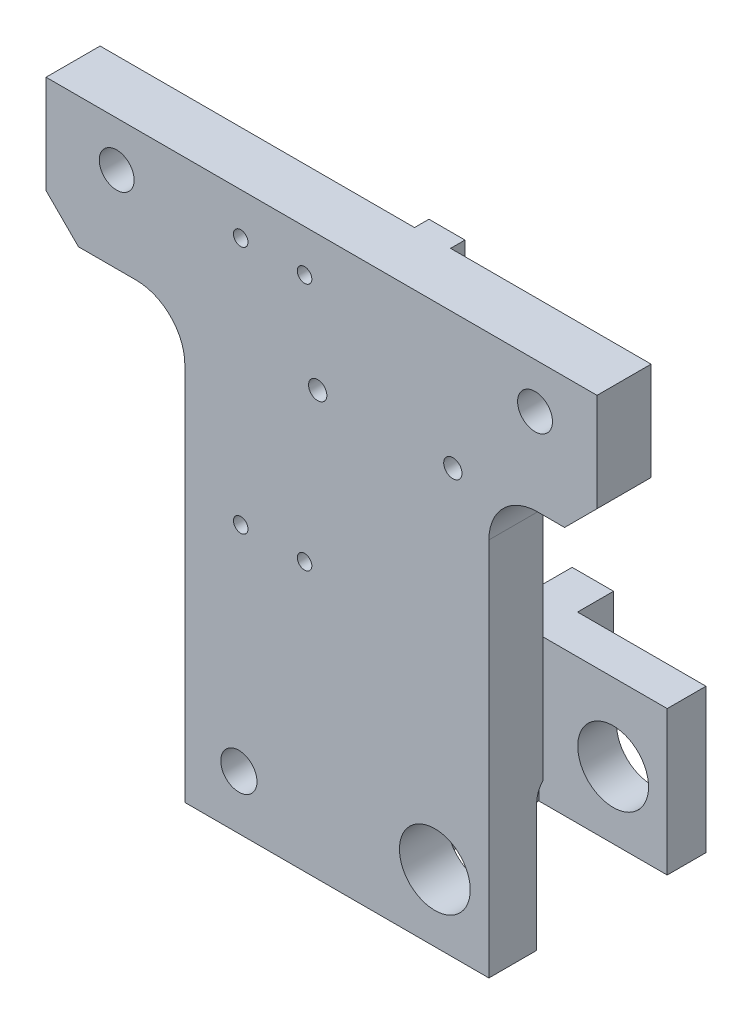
ISO-10303-21;
HEADER;
FILE_DESCRIPTION(('STEP AP214'),'2;1');
FILE_NAME('part.step','',(''),(''),'','','');
FILE_SCHEMA(('AUTOMOTIVE_DESIGN { 1 0 10303 214 1 1 1 1 }'));
ENDSEC;
DATA;
#1=APPLICATION_CONTEXT('core data for automotive mechanical design processes');
#2=APPLICATION_PROTOCOL_DEFINITION('international standard','automotive_design',2000,#1);
#3=PRODUCT_CONTEXT('',#1,'mechanical');
#4=PRODUCT('Part','Part','',(#3));
#5=PRODUCT_RELATED_PRODUCT_CATEGORY('part','',(#4));
#6=PRODUCT_DEFINITION_FORMATION('','',#4);
#7=PRODUCT_DEFINITION_CONTEXT('part definition',#1,'design');
#8=PRODUCT_DEFINITION('design','',#6,#7);
#9=PRODUCT_DEFINITION_SHAPE('','',#8);
#10=(LENGTH_UNIT() NAMED_UNIT(*) SI_UNIT(.MILLI.,.METRE.));
#11=(NAMED_UNIT(*) PLANE_ANGLE_UNIT() SI_UNIT($,.RADIAN.));
#12=(NAMED_UNIT(*) SI_UNIT($,.STERADIAN.) SOLID_ANGLE_UNIT());
#13=UNCERTAINTY_MEASURE_WITH_UNIT(LENGTH_MEASURE(1.E-05),#10,'distance_accuracy_value','');
#14=(GEOMETRIC_REPRESENTATION_CONTEXT(3) GLOBAL_UNCERTAINTY_ASSIGNED_CONTEXT((#13)) GLOBAL_UNIT_ASSIGNED_CONTEXT((#10,
#11,#12)) REPRESENTATION_CONTEXT('',''));
#15=CARTESIAN_POINT('',(0.,0.,0.));
#16=DIRECTION('',(0.,0.,1.));
#17=DIRECTION('',(1.,0.,0.));
#18=AXIS2_PLACEMENT_3D('',#15,#16,#17);
#19=CARTESIAN_POINT('',(12.37869,0.,-49.5395851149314));
#20=DIRECTION('',(-1.,0.,0.));
#21=DIRECTION('',(0.,-1.,0.));
#22=AXIS2_PLACEMENT_3D('',#19,#20,#21);
#23=PLANE('',#22);
#24=CARTESIAN_POINT('',(12.37869,-4.44500000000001,-6.38379999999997));
#25=DIRECTION('',(-1.,0.,0.));
#26=DIRECTION('',(0.,-1.,0.));
#27=AXIS2_PLACEMENT_3D('',#24,#25,#26);
#28=CIRCLE('',#27,1.28904999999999);
#29=CARTESIAN_POINT('',(12.37869,-5.73405,-6.38379999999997));
#30=VERTEX_POINT('',#29);
#31=EDGE_CURVE('E383',#30,#30,#28,.T.);
#32=ORIENTED_EDGE('',*,*,#31,.T.);
#33=EDGE_LOOP('',(#32));
#34=FACE_BOUND('',#33,.T.);
#35=DIRECTION('',(0.,0.,1.));
#36=VECTOR('',#35,1.);
#37=CARTESIAN_POINT('',(12.37869,-20.32,-49.5395851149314));
#38=LINE('',#37,#36);
#39=CARTESIAN_POINT('',(12.37869,-20.32,-9.05079999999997));
#40=VERTEX_POINT('',#39);
#41=CARTESIAN_POINT('',(12.37869,-20.32,0.889));
#42=VERTEX_POINT('',#41);
#43=EDGE_CURVE('E550',#40,#42,#38,.T.);
#44=ORIENTED_EDGE('',*,*,#43,.F.);
#45=DIRECTION('',(0.,1.,0.));
#46=VECTOR('',#45,1.);
#47=CARTESIAN_POINT('',(12.37869,0.,-9.05079999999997));
#48=LINE('',#47,#46);
#49=CARTESIAN_POINT('',(12.37869,0.,-9.05079999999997));
#50=VERTEX_POINT('',#49);
#51=EDGE_CURVE('E293',#40,#50,#48,.T.);
#52=ORIENTED_EDGE('',*,*,#51,.T.);
#53=DIRECTION('',(0.,0.,1.));
#54=VECTOR('',#53,1.);
#55=CARTESIAN_POINT('',(12.37869,0.,-49.5395851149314));
#56=LINE('',#55,#54);
#57=CARTESIAN_POINT('',(12.37869,0.,0.));
#58=VERTEX_POINT('',#57);
#59=EDGE_CURVE('E453',#50,#58,#56,.T.);
#60=ORIENTED_EDGE('',*,*,#59,.T.);
#61=CARTESIAN_POINT('',(12.37869,-2.35207291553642,-2.667));
#62=DIRECTION('',(-1.,0.,0.));
#63=DIRECTION('',(0.,-1.,0.));
#64=AXIS2_PLACEMENT_3D('',#61,#62,#63);
#65=CIRCLE('',#64,3.556);
#66=CARTESIAN_POINT('',(12.37869,-2.35207291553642,0.888999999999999));
#67=VERTEX_POINT('',#66);
#68=EDGE_CURVE('E539',#58,#67,#65,.F.);
#69=ORIENTED_EDGE('',*,*,#68,.T.);
#70=DIRECTION('',(0.,1.,0.));
#71=VECTOR('',#70,1.);
#72=CARTESIAN_POINT('',(12.37869,-20.32,0.889));
#73=LINE('',#72,#71);
#74=EDGE_CURVE('E514',#42,#67,#73,.T.);
#75=ORIENTED_EDGE('',*,*,#74,.F.);
#76=EDGE_LOOP('',(#44,#52,#60,#69,#75));
#77=FACE_BOUND('',#76,.T.);
#78=ADVANCED_FACE('F33',(#34,#77),#23,.F.);
#79=CARTESIAN_POINT('',(7.00000000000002,0.,-3.2));
#80=DIRECTION('',(0.,0.,1.));
#81=DIRECTION('',(0.,1.,0.));
#82=AXIS2_PLACEMENT_3D('',#79,#80,#81);
#83=PLANE('',#82);
#84=CARTESIAN_POINT('',(-4.75868999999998,-12.7,-3.2));
#85=DIRECTION('',(0.,0.,-1.));
#86=DIRECTION('',(0.,1.,0.));
#87=AXIS2_PLACEMENT_3D('',#84,#85,#86);
#88=CIRCLE('',#87,4.76249999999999);
#89=CARTESIAN_POINT('',(-4.75868999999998,-7.93750000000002,-3.2));
#90=VERTEX_POINT('',#89);
#91=EDGE_CURVE('E350',#90,#90,#88,.T.);
#92=ORIENTED_EDGE('',*,*,#91,.F.);
#93=EDGE_LOOP('',(#92));
#94=FACE_BOUND('',#93,.T.);
#95=DIRECTION('',(0.,1.,0.));
#96=VECTOR('',#95,1.);
#97=CARTESIAN_POINT('',(6.53669000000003,0.,-3.2));
#98=LINE('',#97,#96);
#99=CARTESIAN_POINT('',(6.53669000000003,-8.51808302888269,-3.2));
#100=VERTEX_POINT('',#99);
#101=CARTESIAN_POINT('',(6.53669000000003,0.,-3.2));
#102=VERTEX_POINT('',#101);
#103=EDGE_CURVE('E338',#100,#102,#98,.T.);
#104=ORIENTED_EDGE('',*,*,#103,.F.);
#105=CARTESIAN_POINT('',(2.98069000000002,-8.51808302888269,-3.2));
#106=DIRECTION('',(0.,0.,1.));
#107=DIRECTION('',(1.,0.,0.));
#108=AXIS2_PLACEMENT_3D('',#105,#106,#107);
#109=CIRCLE('',#108,3.556);
#110=CARTESIAN_POINT('',(3.23469000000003,-12.065,-3.2));
#111=VERTEX_POINT('',#110);
#112=EDGE_CURVE('E730',#100,#111,#109,.F.);
#113=ORIENTED_EDGE('',*,*,#112,.T.);
#114=DIRECTION('',(0.,1.,0.));
#115=VECTOR('',#114,1.);
#116=CARTESIAN_POINT('',(3.23469000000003,-20.32,-3.2));
#117=LINE('',#116,#115);
#118=CARTESIAN_POINT('',(3.23469000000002,-20.32,-3.2));
#119=VERTEX_POINT('',#118);
#120=EDGE_CURVE('E311',#119,#111,#117,.T.);
#121=ORIENTED_EDGE('',*,*,#120,.F.);
#122=DIRECTION('',(-1.,0.,0.));
#123=VECTOR('',#122,1.);
#124=CARTESIAN_POINT('',(-12.37869,-20.32,-3.19999999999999));
#125=LINE('',#124,#123);
#126=CARTESIAN_POINT('',(-12.37869,-20.32,-3.19999999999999));
#127=VERTEX_POINT('',#126);
#128=EDGE_CURVE('E749',#119,#127,#125,.T.);
#129=ORIENTED_EDGE('',*,*,#128,.T.);
#130=DIRECTION('',(0.,1.,0.));
#131=VECTOR('',#130,1.);
#132=CARTESIAN_POINT('',(-12.37869,-20.32,-3.19999999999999));
#133=LINE('',#132,#131);
#134=CARTESIAN_POINT('',(-12.37869,0.,-3.2));
#135=VERTEX_POINT('',#134);
#136=EDGE_CURVE('E753',#127,#135,#133,.T.);
#137=ORIENTED_EDGE('',*,*,#136,.T.);
#138=DIRECTION('',(1.,0.,0.));
#139=VECTOR('',#138,1.);
#140=CARTESIAN_POINT('',(-12.37869,0.,-3.2));
#141=LINE('',#140,#139);
#142=EDGE_CURVE('E754',#135,#102,#141,.T.);
#143=ORIENTED_EDGE('',*,*,#142,.T.);
#144=EDGE_LOOP('',(#104,#113,#121,#129,#137,#143));
#145=FACE_BOUND('',#144,.T.);
#146=ADVANCED_FACE('F662',(#94,#145),#83,.F.);
#147=CARTESIAN_POINT('',(6.53669000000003,0.,-3.2));
#148=DIRECTION('',(1.,0.,0.));
#149=DIRECTION('',(0.,0.,-1.));
#150=AXIS2_PLACEMENT_3D('',#147,#148,#149);
#151=PLANE('',#150);
#152=CARTESIAN_POINT('',(6.53669000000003,-4.44500000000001,-6.38379999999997));
#153=DIRECTION('',(1.,0.,0.));
#154=DIRECTION('',(0.,0.,-1.));
#155=AXIS2_PLACEMENT_3D('',#152,#153,#154);
#156=CIRCLE('',#155,1.28904999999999);
#157=CARTESIAN_POINT('',(6.53669000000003,-4.44500000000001,-7.67284999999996));
#158=VERTEX_POINT('',#157);
#159=EDGE_CURVE('E347',#158,#158,#156,.F.);
#160=ORIENTED_EDGE('',*,*,#159,.F.);
#161=EDGE_LOOP('',(#160));
#162=FACE_BOUND('',#161,.T.);
#163=CARTESIAN_POINT('',(6.53669000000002,-4.44500000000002,-25.4338));
#164=DIRECTION('',(1.,0.,0.));
#165=DIRECTION('',(0.,0.,-1.));
#166=AXIS2_PLACEMENT_3D('',#163,#164,#165);
#167=CIRCLE('',#166,1.28904999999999);
#168=CARTESIAN_POINT('',(6.53669000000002,-4.44500000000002,-26.72285));
#169=VERTEX_POINT('',#168);
#170=EDGE_CURVE('E346',#169,#169,#167,.F.);
#171=ORIENTED_EDGE('',*,*,#170,.F.);
#172=EDGE_LOOP('',(#171));
#173=FACE_BOUND('',#172,.T.);
#174=DIRECTION('',(0.,-1.,0.));
#175=VECTOR('',#174,1.);
#176=CARTESIAN_POINT('',(6.53669000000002,0.,-28.052));
#177=LINE('',#176,#175);
#178=CARTESIAN_POINT('',(6.53669000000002,0.,-28.052));
#179=VERTEX_POINT('',#178);
#180=CARTESIAN_POINT('',(6.53669000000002,-8.5180830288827,-28.052));
#181=VERTEX_POINT('',#180);
#182=EDGE_CURVE('E344',#179,#181,#177,.T.);
#183=ORIENTED_EDGE('',*,*,#182,.T.);
#184=DIRECTION('',(0.,0.,1.));
#185=VECTOR('',#184,1.);
#186=CARTESIAN_POINT('',(6.53669000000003,-8.51808302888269,-3.2));
#187=LINE('',#186,#185);
#188=EDGE_CURVE('E722',#181,#100,#187,.T.);
#189=ORIENTED_EDGE('',*,*,#188,.T.);
#190=ORIENTED_EDGE('',*,*,#103,.T.);
#191=DIRECTION('',(0.,0.,-1.));
#192=VECTOR('',#191,1.);
#193=CARTESIAN_POINT('',(6.53669000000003,0.,-3.2));
#194=LINE('',#193,#192);
#195=CARTESIAN_POINT('',(6.53669000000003,0.,-9.05079999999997));
#196=VERTEX_POINT('',#195);
#197=EDGE_CURVE('E341',#102,#196,#194,.T.);
#198=ORIENTED_EDGE('',*,*,#197,.T.);
#199=DIRECTION('',(0.,1.,0.));
#200=VECTOR('',#199,1.);
#201=CARTESIAN_POINT('',(6.53669000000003,0.,-9.05079999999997));
#202=LINE('',#201,#200);
#203=CARTESIAN_POINT('',(6.53669000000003,-6.47700000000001,-9.05079999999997));
#204=VERTEX_POINT('',#203);
#205=EDGE_CURVE('E329',#204,#196,#202,.T.);
#206=ORIENTED_EDGE('',*,*,#205,.F.);
#207=CARTESIAN_POINT('',(6.53669000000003,-6.47700000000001,-10.8288));
#208=DIRECTION('',(1.,0.,0.));
#209=DIRECTION('',(0.,0.,-1.));
#210=AXIS2_PLACEMENT_3D('',#207,#208,#209);
#211=CIRCLE('',#210,1.778);
#212=CARTESIAN_POINT('',(6.53669000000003,-8.25500000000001,-10.8288));
#213=VERTEX_POINT('',#212);
#214=EDGE_CURVE('E719',#204,#213,#211,.T.);
#215=ORIENTED_EDGE('',*,*,#214,.T.);
#216=DIRECTION('',(0.,0.,1.));
#217=VECTOR('',#216,1.);
#218=CARTESIAN_POINT('',(6.53669000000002,-8.25500000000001,-13.1148));
#219=LINE('',#218,#217);
#220=CARTESIAN_POINT('',(6.53669000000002,-8.25500000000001,-11.3368));
#221=VERTEX_POINT('',#220);
#222=EDGE_CURVE('E326',#221,#213,#219,.T.);
#223=ORIENTED_EDGE('',*,*,#222,.F.);
#224=CARTESIAN_POINT('',(6.53669000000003,-6.47700000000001,-11.3368));
#225=DIRECTION('',(1.,0.,0.));
#226=DIRECTION('',(0.,0.,-1.));
#227=AXIS2_PLACEMENT_3D('',#224,#225,#226);
#228=CIRCLE('',#227,1.778);
#229=CARTESIAN_POINT('',(6.53669000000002,-6.47700000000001,-13.1148));
#230=VERTEX_POINT('',#229);
#231=EDGE_CURVE('E716',#221,#230,#228,.T.);
#232=ORIENTED_EDGE('',*,*,#231,.T.);
#233=DIRECTION('',(0.,-1.,0.));
#234=VECTOR('',#233,1.);
#235=CARTESIAN_POINT('',(6.53669000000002,0.,-13.1148));
#236=LINE('',#235,#234);
#237=CARTESIAN_POINT('',(6.53669000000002,0.,-13.1148));
#238=VERTEX_POINT('',#237);
#239=EDGE_CURVE('E315',#238,#230,#236,.T.);
#240=ORIENTED_EDGE('',*,*,#239,.F.);
#241=EDGE_CURVE('E340',#238,#179,#194,.T.);
#242=ORIENTED_EDGE('',*,*,#241,.T.);
#243=EDGE_LOOP('',(#183,#189,#190,#198,#206,#215,#223,#232,#240,#242));
#244=FACE_BOUND('',#243,.T.);
#245=ADVANCED_FACE('F669',(#162,#173,#244),#151,.F.);
#246=CARTESIAN_POINT('',(-12.37869,0.,-49.5395851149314));
#247=DIRECTION('',(0.,-1.,0.));
#248=DIRECTION('',(1.,0.,0.));
#249=AXIS2_PLACEMENT_3D('',#246,#247,#248);
#250=PLANE('',#249);
#251=ORIENTED_EDGE('',*,*,#241,.F.);
#252=DIRECTION('',(-1.,0.,0.));
#253=VECTOR('',#252,1.);
#254=CARTESIAN_POINT('',(45.72,0.,-13.1148));
#255=LINE('',#254,#253);
#256=CARTESIAN_POINT('',(12.37869,0.,-13.1148));
#257=VERTEX_POINT('',#256);
#258=EDGE_CURVE('E332',#257,#238,#255,.T.);
#259=ORIENTED_EDGE('',*,*,#258,.F.);
#260=CARTESIAN_POINT('',(12.37869,0.,-17.511));
#261=VERTEX_POINT('',#260);
#262=EDGE_CURVE('E456',#261,#257,#56,.T.);
#263=ORIENTED_EDGE('',*,*,#262,.F.);
#264=DIRECTION('',(1.,0.,0.));
#265=VECTOR('',#264,1.);
#266=CARTESIAN_POINT('',(-12.37869,0.,-17.511));
#267=LINE('',#266,#265);
#268=CARTESIAN_POINT('',(30.48,0.,-17.511));
#269=VERTEX_POINT('',#268);
#270=EDGE_CURVE('E509',#261,#269,#267,.T.);
#271=ORIENTED_EDGE('',*,*,#270,.T.);
#272=DIRECTION('',(0.,0.,1.));
#273=VECTOR('',#272,1.);
#274=CARTESIAN_POINT('',(30.48,0.,-22.972));
#275=LINE('',#274,#273);
#276=CARTESIAN_POINT('',(30.48,0.,-22.972));
#277=VERTEX_POINT('',#276);
#278=EDGE_CURVE('E526',#277,#269,#275,.T.);
#279=ORIENTED_EDGE('',*,*,#278,.F.);
#280=DIRECTION('',(1.,0.,0.));
#281=VECTOR('',#280,1.);
#282=CARTESIAN_POINT('',(-12.37869,0.,-22.972));
#283=LINE('',#282,#281);
#284=CARTESIAN_POINT('',(12.37869,0.,-22.972));
#285=VERTEX_POINT('',#284);
#286=EDGE_CURVE('E493',#285,#277,#283,.T.);
#287=ORIENTED_EDGE('',*,*,#286,.F.);
#288=DIRECTION('',(0.,0.,1.));
#289=VECTOR('',#288,1.);
#290=CARTESIAN_POINT('',(12.37869,0.,-28.052));
#291=LINE('',#290,#289);
#292=CARTESIAN_POINT('',(12.37869,0.,-28.052));
#293=VERTEX_POINT('',#292);
#294=EDGE_CURVE('E441',#293,#285,#291,.T.);
#295=ORIENTED_EDGE('',*,*,#294,.F.);
#296=DIRECTION('',(1.,0.,0.));
#297=VECTOR('',#296,1.);
#298=CARTESIAN_POINT('',(6.02869000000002,0.,-28.052));
#299=LINE('',#298,#297);
#300=EDGE_CURVE('E421',#179,#293,#299,.T.);
#301=ORIENTED_EDGE('',*,*,#300,.F.);
#302=EDGE_LOOP('',(#251,#259,#263,#271,#279,#287,#295,#301));
#303=FACE_BOUND('',#302,.T.);
#304=ADVANCED_FACE('F572',(#303),#250,.F.);
#305=CARTESIAN_POINT('',(-12.37869,-20.32,7.62));
#306=DIRECTION('',(0.,0.,1.));
#307=DIRECTION('',(1.,0.,0.));
#308=AXIS2_PLACEMENT_3D('',#305,#306,#307);
#309=PLANE('',#308);
#310=CARTESIAN_POINT('',(25.4,39.37,7.62));
#311=DIRECTION('',(0.,0.,1.));
#312=DIRECTION('',(1.,0.,0.));
#313=AXIS2_PLACEMENT_3D('',#310,#311,#312);
#314=CIRCLE('',#313,1.28904999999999);
#315=CARTESIAN_POINT('',(26.68905,39.37,7.62));
#316=VERTEX_POINT('',#315);
#317=EDGE_CURVE('E560',#316,#316,#314,.T.);
#318=ORIENTED_EDGE('',*,*,#317,.F.);
#319=EDGE_LOOP('',(#318));
#320=FACE_BOUND('',#319,.T.);
#321=CARTESIAN_POINT('',(6.34999999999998,39.37,7.62));
#322=DIRECTION('',(0.,0.,1.));
#323=DIRECTION('',(1.,0.,0.));
#324=AXIS2_PLACEMENT_3D('',#321,#322,#323);
#325=CIRCLE('',#324,1.28904999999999);
#326=CARTESIAN_POINT('',(7.63904999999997,39.37,7.62));
#327=VERTEX_POINT('',#326);
#328=EDGE_CURVE('E553',#327,#327,#325,.T.);
#329=ORIENTED_EDGE('',*,*,#328,.F.);
#330=EDGE_LOOP('',(#329));
#331=FACE_BOUND('',#330,.T.);
#332=CARTESIAN_POINT('',(-4.75868999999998,-12.7,7.62000000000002));
#333=DIRECTION('',(0.,0.,-1.));
#334=DIRECTION('',(0.,1.,0.));
#335=AXIS2_PLACEMENT_3D('',#332,#333,#334);
#336=CIRCLE('',#335,2.5527);
#337=CARTESIAN_POINT('',(-4.75868999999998,-10.1473,7.62000000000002));
#338=VERTEX_POINT('',#337);
#339=EDGE_CURVE('E359',#338,#338,#336,.T.);
#340=ORIENTED_EDGE('',*,*,#339,.T.);
#341=EDGE_LOOP('',(#340));
#342=FACE_BOUND('',#341,.T.);
#343=CARTESIAN_POINT('',(-4.49999999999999,52.5,7.62));
#344=DIRECTION('',(0.,0.,-1.));
#345=DIRECTION('',(-1.,0.,0.));
#346=AXIS2_PLACEMENT_3D('',#343,#344,#345);
#347=CIRCLE('',#346,1.025);
#348=CARTESIAN_POINT('',(-5.52499999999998,52.5,7.62));
#349=VERTEX_POINT('',#348);
#350=EDGE_CURVE('E384',#349,#349,#347,.T.);
#351=ORIENTED_EDGE('',*,*,#350,.T.);
#352=EDGE_LOOP('',(#351));
#353=FACE_BOUND('',#352,.T.);
#354=CARTESIAN_POINT('',(4.50000000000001,52.5,7.62));
#355=DIRECTION('',(0.,0.,-1.));
#356=DIRECTION('',(-1.,0.,0.));
#357=AXIS2_PLACEMENT_3D('',#354,#355,#356);
#358=CIRCLE('',#357,1.025);
#359=CARTESIAN_POINT('',(3.47500000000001,52.5,7.62));
#360=VERTEX_POINT('',#359);
#361=EDGE_CURVE('E390',#360,#360,#358,.T.);
#362=ORIENTED_EDGE('',*,*,#361,.T.);
#363=EDGE_LOOP('',(#362));
#364=FACE_BOUND('',#363,.T.);
#365=CARTESIAN_POINT('',(4.50000000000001,17.5,7.62));
#366=DIRECTION('',(0.,0.,-1.));
#367=DIRECTION('',(-1.,0.,0.));
#368=AXIS2_PLACEMENT_3D('',#365,#366,#367);
#369=CIRCLE('',#368,1.025);
#370=CARTESIAN_POINT('',(3.47500000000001,17.5,7.62));
#371=VERTEX_POINT('',#370);
#372=EDGE_CURVE('E396',#371,#371,#369,.T.);
#373=ORIENTED_EDGE('',*,*,#372,.T.);
#374=EDGE_LOOP('',(#373));
#375=FACE_BOUND('',#374,.T.);
#376=DIRECTION('',(1.,0.,0.));
#377=VECTOR('',#376,1.);
#378=CARTESIAN_POINT('',(30.48,40.005,7.62));
#379=LINE('',#378,#377);
#380=CARTESIAN_POINT('',(37.338,40.005,7.62));
#381=VERTEX_POINT('',#380);
#382=CARTESIAN_POINT('',(41.148,40.005,7.62));
#383=VERTEX_POINT('',#382);
#384=EDGE_CURVE('E586',#381,#383,#379,.T.);
#385=ORIENTED_EDGE('',*,*,#384,.T.);
#386=DIRECTION('',(-0.707106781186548,-0.707106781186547,0.));
#387=VECTOR('',#386,1.);
#388=CARTESIAN_POINT('',(-15.777845,-16.9208449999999,7.62));
#389=LINE('',#388,#387);
#390=CARTESIAN_POINT('',(45.72,44.577,7.62));
#391=VERTEX_POINT('',#390);
#392=EDGE_CURVE('E487',#383,#391,#389,.F.);
#393=ORIENTED_EDGE('',*,*,#392,.T.);
#394=DIRECTION('',(0.,1.,0.));
#395=VECTOR('',#394,1.);
#396=CARTESIAN_POINT('',(45.72,58.42,7.62));
#397=LINE('',#396,#395);
#398=CARTESIAN_POINT('',(45.72,58.42,7.62));
#399=VERTEX_POINT('',#398);
#400=EDGE_CURVE('E512',#391,#399,#397,.T.);
#401=ORIENTED_EDGE('',*,*,#400,.T.);
#402=DIRECTION('',(-1.,0.,0.));
#403=VECTOR('',#402,1.);
#404=CARTESIAN_POINT('',(-12.37869,58.42,7.62));
#405=LINE('',#404,#403);
#406=CARTESIAN_POINT('',(-31.93669,58.42,7.62));
#407=VERTEX_POINT('',#406);
#408=EDGE_CURVE('E636',#399,#407,#405,.T.);
#409=ORIENTED_EDGE('',*,*,#408,.T.);
#410=DIRECTION('',(0.,-1.,0.));
#411=VECTOR('',#410,1.);
#412=CARTESIAN_POINT('',(-31.93669,58.42,7.62));
#413=LINE('',#412,#411);
#414=CARTESIAN_POINT('',(-31.93669,44.577,7.62));
#415=VERTEX_POINT('',#414);
#416=EDGE_CURVE('E485',#407,#415,#413,.T.);
#417=ORIENTED_EDGE('',*,*,#416,.T.);
#418=DIRECTION('',(-0.707106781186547,0.707106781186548,0.));
#419=VECTOR('',#418,1.);
#420=CARTESIAN_POINT('',(10.29081,2.34949999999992,7.62));
#421=LINE('',#420,#419);
#422=CARTESIAN_POINT('',(-27.36469,40.005,7.62));
#423=VERTEX_POINT('',#422);
#424=EDGE_CURVE('E483',#415,#423,#421,.F.);
#425=ORIENTED_EDGE('',*,*,#424,.T.);
#426=DIRECTION('',(1.,0.,0.));
#427=VECTOR('',#426,1.);
#428=CARTESIAN_POINT('',(-12.37869,40.005,7.62));
#429=LINE('',#428,#427);
#430=CARTESIAN_POINT('',(-19.23669,40.005,7.62));
#431=VERTEX_POINT('',#430);
#432=EDGE_CURVE('E473',#423,#431,#429,.T.);
#433=ORIENTED_EDGE('',*,*,#432,.T.);
#434=CARTESIAN_POINT('',(-19.23669,33.147,7.62));
#435=DIRECTION('',(0.,0.,1.));
#436=DIRECTION('',(1.,0.,0.));
#437=AXIS2_PLACEMENT_3D('',#434,#435,#436);
#438=CIRCLE('',#437,6.858);
#439=CARTESIAN_POINT('',(-12.37869,33.147,7.62));
#440=VERTEX_POINT('',#439);
#441=EDGE_CURVE('E780',#431,#440,#438,.F.);
#442=ORIENTED_EDGE('',*,*,#441,.T.);
#443=DIRECTION('',(0.,-1.,0.));
#444=VECTOR('',#443,1.);
#445=CARTESIAN_POINT('',(-12.37869,58.42,7.62));
#446=LINE('',#445,#444);
#447=CARTESIAN_POINT('',(-12.37869,-20.32,7.62));
#448=VERTEX_POINT('',#447);
#449=EDGE_CURVE('E808',#440,#448,#446,.T.);
#450=ORIENTED_EDGE('',*,*,#449,.T.);
#451=DIRECTION('',(1.,0.,0.));
#452=VECTOR('',#451,1.);
#453=CARTESIAN_POINT('',(-12.37869,-20.32,7.62));
#454=LINE('',#453,#452);
#455=CARTESIAN_POINT('',(30.48,-20.32,7.62));
#456=VERTEX_POINT('',#455);
#457=EDGE_CURVE('E815',#448,#456,#454,.T.);
#458=ORIENTED_EDGE('',*,*,#457,.T.);
#459=DIRECTION('',(0.,1.,0.));
#460=VECTOR('',#459,1.);
#461=CARTESIAN_POINT('',(30.48,58.42,7.62));
#462=LINE('',#461,#460);
#463=CARTESIAN_POINT('',(30.48,33.147,7.62));
#464=VERTEX_POINT('',#463);
#465=EDGE_CURVE('E644',#456,#464,#462,.T.);
#466=ORIENTED_EDGE('',*,*,#465,.T.);
#467=CARTESIAN_POINT('',(37.338,33.147,7.62));
#468=DIRECTION('',(0.,0.,1.));
#469=DIRECTION('',(1.,0.,0.));
#470=AXIS2_PLACEMENT_3D('',#467,#468,#469);
#471=CIRCLE('',#470,6.858);
#472=EDGE_CURVE('E797',#464,#381,#471,.F.);
#473=ORIENTED_EDGE('',*,*,#472,.T.);
#474=EDGE_LOOP('',(#385,#393,#401,#409,#417,#425,#433,#442,#450,#458,#466,#473));
#475=FACE_BOUND('',#474,.T.);
#476=CARTESIAN_POINT('',(22.8600000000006,-10.89,7.62));
#477=DIRECTION('',(0.,0.,1.));
#478=DIRECTION('',(1.,0.,0.));
#479=AXIS2_PLACEMENT_3D('',#476,#477,#478);
#480=CIRCLE('',#479,4.99109999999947);
#481=CARTESIAN_POINT('',(27.8511000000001,-10.89,7.62));
#482=VERTEX_POINT('',#481);
#483=EDGE_CURVE('E446',#482,#482,#480,.T.);
#484=ORIENTED_EDGE('',*,*,#483,.F.);
#485=EDGE_LOOP('',(#484));
#486=FACE_BOUND('',#485,.T.);
#487=CARTESIAN_POINT('',(36.9824,52.07,7.62));
#488=DIRECTION('',(0.,0.,-1.));
#489=DIRECTION('',(-1.,0.,0.));
#490=AXIS2_PLACEMENT_3D('',#487,#488,#489);
#491=CIRCLE('',#490,2.45745);
#492=CARTESIAN_POINT('',(34.52495,52.07,7.62));
#493=VERTEX_POINT('',#492);
#494=EDGE_CURVE('E417',#493,#493,#491,.T.);
#495=ORIENTED_EDGE('',*,*,#494,.T.);
#496=EDGE_LOOP('',(#495));
#497=FACE_BOUND('',#496,.T.);
#498=CARTESIAN_POINT('',(-21.97989,52.07,7.62));
#499=DIRECTION('',(0.,0.,-1.));
#500=DIRECTION('',(-1.,0.,0.));
#501=AXIS2_PLACEMENT_3D('',#498,#499,#500);
#502=CIRCLE('',#501,2.45745);
#503=CARTESIAN_POINT('',(-24.43734,52.07,7.62));
#504=VERTEX_POINT('',#503);
#505=EDGE_CURVE('E411',#504,#504,#502,.T.);
#506=ORIENTED_EDGE('',*,*,#505,.T.);
#507=EDGE_LOOP('',(#506));
#508=FACE_BOUND('',#507,.T.);
#509=CARTESIAN_POINT('',(-4.49999999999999,17.5,7.62));
#510=DIRECTION('',(0.,0.,-1.));
#511=DIRECTION('',(-1.,0.,0.));
#512=AXIS2_PLACEMENT_3D('',#509,#510,#511);
#513=CIRCLE('',#512,1.025);
#514=CARTESIAN_POINT('',(-5.52499999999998,17.5,7.62));
#515=VERTEX_POINT('',#514);
#516=EDGE_CURVE('E402',#515,#515,#513,.T.);
#517=ORIENTED_EDGE('',*,*,#516,.T.);
#518=EDGE_LOOP('',(#517));
#519=FACE_BOUND('',#518,.T.);
#520=ADVANCED_FACE('F568',(#320,#331,#342,#353,#364,#375,#475,#486,#497,#508,#519),#309,.T.);
#521=CARTESIAN_POINT('',(-12.37869,-20.32,0.));
#522=DIRECTION('',(0.,0.,1.));
#523=DIRECTION('',(1.,0.,0.));
#524=AXIS2_PLACEMENT_3D('',#521,#522,#523);
#525=PLANE('',#524);
#526=CARTESIAN_POINT('',(25.4,39.37,0.));
#527=DIRECTION('',(0.,0.,1.));
#528=DIRECTION('',(1.,0.,0.));
#529=AXIS2_PLACEMENT_3D('',#526,#527,#528);
#530=CIRCLE('',#529,1.28904999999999);
#531=CARTESIAN_POINT('',(26.68905,39.37,0.));
#532=VERTEX_POINT('',#531);
#533=EDGE_CURVE('E37',#532,#532,#530,.T.);
#534=ORIENTED_EDGE('',*,*,#533,.T.);
#535=EDGE_LOOP('',(#534));
#536=FACE_BOUND('',#535,.T.);
#537=CARTESIAN_POINT('',(6.34999999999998,39.37,0.));
#538=DIRECTION('',(0.,0.,1.));
#539=DIRECTION('',(1.,0.,0.));
#540=AXIS2_PLACEMENT_3D('',#537,#538,#539);
#541=CIRCLE('',#540,1.28904999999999);
#542=CARTESIAN_POINT('',(7.63904999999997,39.37,0.));
#543=VERTEX_POINT('',#542);
#544=EDGE_CURVE('E286',#543,#543,#541,.T.);
#545=ORIENTED_EDGE('',*,*,#544,.T.);
#546=EDGE_LOOP('',(#545));
#547=FACE_BOUND('',#546,.T.);
#548=CARTESIAN_POINT('',(-4.49999999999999,52.5,0.));
#549=DIRECTION('',(0.,0.,-1.));
#550=DIRECTION('',(-1.,0.,0.));
#551=AXIS2_PLACEMENT_3D('',#548,#549,#550);
#552=CIRCLE('',#551,1.02499999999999);
#553=CARTESIAN_POINT('',(-5.52499999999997,52.5,0.));
#554=VERTEX_POINT('',#553);
#555=EDGE_CURVE('E387',#554,#554,#552,.T.);
#556=ORIENTED_EDGE('',*,*,#555,.F.);
#557=EDGE_LOOP('',(#556));
#558=FACE_BOUND('',#557,.T.);
#559=CARTESIAN_POINT('',(4.50000000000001,52.5,0.));
#560=DIRECTION('',(0.,0.,-1.));
#561=DIRECTION('',(-1.,0.,0.));
#562=AXIS2_PLACEMENT_3D('',#559,#560,#561);
#563=CIRCLE('',#562,1.02499999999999);
#564=CARTESIAN_POINT('',(3.47500000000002,52.5,0.));
#565=VERTEX_POINT('',#564);
#566=EDGE_CURVE('E393',#565,#565,#563,.T.);
#567=ORIENTED_EDGE('',*,*,#566,.F.);
#568=EDGE_LOOP('',(#567));
#569=FACE_BOUND('',#568,.T.);
#570=CARTESIAN_POINT('',(4.50000000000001,17.5,0.));
#571=DIRECTION('',(0.,0.,-1.));
#572=DIRECTION('',(-1.,0.,0.));
#573=AXIS2_PLACEMENT_3D('',#570,#571,#572);
#574=CIRCLE('',#573,1.02499999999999);
#575=CARTESIAN_POINT('',(3.47500000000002,17.5,0.));
#576=VERTEX_POINT('',#575);
#577=EDGE_CURVE('E399',#576,#576,#574,.T.);
#578=ORIENTED_EDGE('',*,*,#577,.F.);
#579=EDGE_LOOP('',(#578));
#580=FACE_BOUND('',#579,.T.);
#581=CARTESIAN_POINT('',(-4.49999999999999,17.5,0.));
#582=DIRECTION('',(0.,0.,-1.));
#583=DIRECTION('',(-1.,0.,0.));
#584=AXIS2_PLACEMENT_3D('',#581,#582,#583);
#585=CIRCLE('',#584,1.02499999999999);
#586=CARTESIAN_POINT('',(-5.52499999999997,17.5,0.));
#587=VERTEX_POINT('',#586);
#588=EDGE_CURVE('E405',#587,#587,#585,.T.);
#589=ORIENTED_EDGE('',*,*,#588,.F.);
#590=EDGE_LOOP('',(#589));
#591=FACE_BOUND('',#590,.T.);
#592=CARTESIAN_POINT('',(-21.97989,52.07,0.));
#593=DIRECTION('',(0.,0.,-1.));
#594=DIRECTION('',(-1.,0.,0.));
#595=AXIS2_PLACEMENT_3D('',#592,#593,#594);
#596=CIRCLE('',#595,2.45744999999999);
#597=CARTESIAN_POINT('',(-24.43734,52.07,0.));
#598=VERTEX_POINT('',#597);
#599=EDGE_CURVE('E408',#598,#598,#596,.T.);
#600=ORIENTED_EDGE('',*,*,#599,.F.);
#601=EDGE_LOOP('',(#600));
#602=FACE_BOUND('',#601,.T.);
#603=CARTESIAN_POINT('',(36.9824,52.07,0.));
#604=DIRECTION('',(0.,0.,-1.));
#605=DIRECTION('',(-1.,0.,0.));
#606=AXIS2_PLACEMENT_3D('',#603,#604,#605);
#607=CIRCLE('',#606,2.45744999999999);
#608=CARTESIAN_POINT('',(34.52495,52.07,0.));
#609=VERTEX_POINT('',#608);
#610=EDGE_CURVE('E414',#609,#609,#607,.T.);
#611=ORIENTED_EDGE('',*,*,#610,.F.);
#612=EDGE_LOOP('',(#611));
#613=FACE_BOUND('',#612,.T.);
#614=DIRECTION('',(0.,1.,0.));
#615=VECTOR('',#614,1.);
#616=CARTESIAN_POINT('',(45.72,58.42,0.));
#617=LINE('',#616,#615);
#618=CARTESIAN_POINT('',(45.72,44.577,0.));
#619=VERTEX_POINT('',#618);
#620=CARTESIAN_POINT('',(45.72,58.42,0.));
#621=VERTEX_POINT('',#620);
#622=EDGE_CURVE('E616',#619,#621,#617,.T.);
#623=ORIENTED_EDGE('',*,*,#622,.F.);
#624=DIRECTION('',(0.707106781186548,0.707106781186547,0.));
#625=VECTOR('',#624,1.);
#626=CARTESIAN_POINT('',(45.72,44.577,0.));
#627=LINE('',#626,#625);
#628=CARTESIAN_POINT('',(41.148,40.005,0.));
#629=VERTEX_POINT('',#628);
#630=EDGE_CURVE('E479',#619,#629,#627,.F.);
#631=ORIENTED_EDGE('',*,*,#630,.T.);
#632=DIRECTION('',(1.,0.,0.));
#633=VECTOR('',#632,1.);
#634=CARTESIAN_POINT('',(30.48,40.005,0.));
#635=LINE('',#634,#633);
#636=CARTESIAN_POINT('',(37.338,40.005,0.));
#637=VERTEX_POINT('',#636);
#638=EDGE_CURVE('E626',#637,#629,#635,.T.);
#639=ORIENTED_EDGE('',*,*,#638,.F.);
#640=CARTESIAN_POINT('',(37.338,33.147,0.));
#641=DIRECTION('',(0.,0.,1.));
#642=DIRECTION('',(1.,0.,0.));
#643=AXIS2_PLACEMENT_3D('',#640,#641,#642);
#644=CIRCLE('',#643,6.858);
#645=CARTESIAN_POINT('',(30.48,33.147,0.));
#646=VERTEX_POINT('',#645);
#647=EDGE_CURVE('E795',#637,#646,#644,.T.);
#648=ORIENTED_EDGE('',*,*,#647,.T.);
#649=DIRECTION('',(0.,1.,0.));
#650=VECTOR('',#649,1.);
#651=CARTESIAN_POINT('',(30.48,58.42,0.));
#652=LINE('',#651,#650);
#653=CARTESIAN_POINT('',(30.48,0.,0.));
#654=VERTEX_POINT('',#653);
#655=EDGE_CURVE('E810',#654,#646,#652,.T.);
#656=ORIENTED_EDGE('',*,*,#655,.F.);
#657=DIRECTION('',(1.,0.,0.));
#658=VECTOR('',#657,1.);
#659=CARTESIAN_POINT('',(12.37869,0.,0.));
#660=LINE('',#659,#658);
#661=EDGE_CURVE('E518',#58,#654,#660,.T.);
#662=ORIENTED_EDGE('',*,*,#661,.F.);
#663=DIRECTION('',(1.,0.,0.));
#664=VECTOR('',#663,1.);
#665=CARTESIAN_POINT('',(-12.37869,0.,0.));
#666=LINE('',#665,#664);
#667=CARTESIAN_POINT('',(-12.37869,0.,0.));
#668=VERTEX_POINT('',#667);
#669=EDGE_CURVE('E457',#668,#58,#666,.T.);
#670=ORIENTED_EDGE('',*,*,#669,.F.);
#671=DIRECTION('',(0.,-1.,0.));
#672=VECTOR('',#671,1.);
#673=CARTESIAN_POINT('',(-12.37869,58.42,0.));
#674=LINE('',#673,#672);
#675=CARTESIAN_POINT('',(-12.37869,33.147,0.));
#676=VERTEX_POINT('',#675);
#677=EDGE_CURVE('E534',#676,#668,#674,.T.);
#678=ORIENTED_EDGE('',*,*,#677,.F.);
#679=CARTESIAN_POINT('',(-19.23669,33.147,0.));
#680=DIRECTION('',(0.,0.,1.));
#681=DIRECTION('',(1.,0.,0.));
#682=AXIS2_PLACEMENT_3D('',#679,#680,#681);
#683=CIRCLE('',#682,6.858);
#684=CARTESIAN_POINT('',(-19.23669,40.005,0.));
#685=VERTEX_POINT('',#684);
#686=EDGE_CURVE('E773',#676,#685,#683,.T.);
#687=ORIENTED_EDGE('',*,*,#686,.T.);
#688=DIRECTION('',(1.,0.,0.));
#689=VECTOR('',#688,1.);
#690=CARTESIAN_POINT('',(-12.37869,40.005,0.));
#691=LINE('',#690,#689);
#692=CARTESIAN_POINT('',(-27.36469,40.005,0.));
#693=VERTEX_POINT('',#692);
#694=EDGE_CURVE('E470',#693,#685,#691,.T.);
#695=ORIENTED_EDGE('',*,*,#694,.F.);
#696=DIRECTION('',(0.707106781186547,-0.707106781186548,0.));
#697=VECTOR('',#696,1.);
#698=CARTESIAN_POINT('',(-27.36469,40.005,0.));
#699=LINE('',#698,#697);
#700=CARTESIAN_POINT('',(-31.93669,44.577,0.));
#701=VERTEX_POINT('',#700);
#702=EDGE_CURVE('E477',#693,#701,#699,.F.);
#703=ORIENTED_EDGE('',*,*,#702,.T.);
#704=DIRECTION('',(0.,-1.,0.));
#705=VECTOR('',#704,1.);
#706=CARTESIAN_POINT('',(-31.93669,58.42,0.));
#707=LINE('',#706,#705);
#708=CARTESIAN_POINT('',(-31.93669,58.42,0.));
#709=VERTEX_POINT('',#708);
#710=EDGE_CURVE('E474',#709,#701,#707,.T.);
#711=ORIENTED_EDGE('',*,*,#710,.F.);
#712=DIRECTION('',(-1.,0.,0.));
#713=VECTOR('',#712,1.);
#714=CARTESIAN_POINT('',(-12.37869,58.42,0.));
#715=LINE('',#714,#713);
#716=CARTESIAN_POINT('',(12.37869,58.42,0.));
#717=VERTEX_POINT('',#716);
#718=EDGE_CURVE('E809',#717,#709,#715,.T.);
#719=ORIENTED_EDGE('',*,*,#718,.F.);
#720=DIRECTION('',(0.,1.,0.));
#721=VECTOR('',#720,1.);
#722=CARTESIAN_POINT('',(12.37869,58.42,0.));
#723=LINE('',#722,#721);
#724=CARTESIAN_POINT('',(12.37869,9.906,0.));
#725=VERTEX_POINT('',#724);
#726=EDGE_CURVE('E1422',#725,#717,#723,.T.);
#727=ORIENTED_EDGE('',*,*,#726,.F.);
#728=DIRECTION('',(-1.,0.,0.));
#729=VECTOR('',#728,1.);
#730=CARTESIAN_POINT('',(17.45869,9.906,0.));
#731=LINE('',#730,#729);
#732=CARTESIAN_POINT('',(17.45869,9.906,0.));
#733=VERTEX_POINT('',#732);
#734=EDGE_CURVE('E1431',#733,#725,#731,.T.);
#735=ORIENTED_EDGE('',*,*,#734,.F.);
#736=DIRECTION('',(0.,-1.,0.));
#737=VECTOR('',#736,1.);
#738=CARTESIAN_POINT('',(17.45869,58.42,0.));
#739=LINE('',#738,#737);
#740=CARTESIAN_POINT('',(17.45869,58.42,0.));
#741=VERTEX_POINT('',#740);
#742=EDGE_CURVE('E1414',#741,#733,#739,.T.);
#743=ORIENTED_EDGE('',*,*,#742,.F.);
#744=EDGE_CURVE('E621',#621,#741,#715,.T.);
#745=ORIENTED_EDGE('',*,*,#744,.F.);
#746=EDGE_LOOP('',(#623,#631,#639,#648,#656,#662,#670,#678,#687,#695,#703,#711,#719,#727,#735,
#743,#745));
#747=FACE_BOUND('',#746,.T.);
#748=ADVANCED_FACE('F571',(#536,#547,#558,#569,#580,#591,#602,#613,#747),#525,.F.);
#749=CARTESIAN_POINT('',(30.48,58.42,7.62));
#750=DIRECTION('',(-1.,0.,0.));
#751=DIRECTION('',(0.,-1.,0.));
#752=AXIS2_PLACEMENT_3D('',#749,#750,#751);
#753=PLANE('',#752);
#754=ORIENTED_EDGE('',*,*,#655,.T.);
#755=DIRECTION('',(0.,0.,-1.));
#756=VECTOR('',#755,1.);
#757=CARTESIAN_POINT('',(30.48,33.147,7.62));
#758=LINE('',#757,#756);
#759=EDGE_CURVE('E781',#646,#464,#758,.F.);
#760=ORIENTED_EDGE('',*,*,#759,.T.);
#761=ORIENTED_EDGE('',*,*,#465,.F.);
#762=DIRECTION('',(0.,0.,-1.));
#763=VECTOR('',#762,1.);
#764=CARTESIAN_POINT('',(30.48,-20.32,7.62));
#765=LINE('',#764,#763);
#766=CARTESIAN_POINT('',(30.48,-20.32,0.889));
#767=VERTEX_POINT('',#766);
#768=EDGE_CURVE('E643',#456,#767,#765,.T.);
#769=ORIENTED_EDGE('',*,*,#768,.T.);
#770=DIRECTION('',(0.,-1.,0.));
#771=VECTOR('',#770,1.);
#772=CARTESIAN_POINT('',(30.48,-20.32,0.889));
#773=LINE('',#772,#771);
#774=CARTESIAN_POINT('',(30.48,-2.35207291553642,0.889));
#775=VERTEX_POINT('',#774);
#776=EDGE_CURVE('E517',#775,#767,#773,.T.);
#777=ORIENTED_EDGE('',*,*,#776,.F.);
#778=CARTESIAN_POINT('',(30.48,-2.35207291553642,-2.667));
#779=DIRECTION('',(-1.,0.,0.));
#780=DIRECTION('',(0.,-1.,0.));
#781=AXIS2_PLACEMENT_3D('',#778,#779,#780);
#782=CIRCLE('',#781,3.556);
#783=EDGE_CURVE('E536',#775,#654,#782,.T.);
#784=ORIENTED_EDGE('',*,*,#783,.T.);
#785=EDGE_LOOP('',(#754,#760,#761,#769,#777,#784));
#786=FACE_BOUND('',#785,.T.);
#787=ADVANCED_FACE('F607',(#786),#753,.F.);
#788=CARTESIAN_POINT('',(-12.37869,58.42,7.62));
#789=DIRECTION('',(1.,0.,0.));
#790=DIRECTION('',(0.,1.,0.));
#791=AXIS2_PLACEMENT_3D('',#788,#789,#790);
#792=PLANE('',#791);
#793=CARTESIAN_POINT('',(-12.37869,-3.17500000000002,4.445));
#794=DIRECTION('',(-1.,0.,0.));
#795=DIRECTION('',(0.,0.,1.));
#796=AXIS2_PLACEMENT_3D('',#793,#794,#795);
#797=CIRCLE('',#796,1.1303);
#798=CARTESIAN_POINT('',(-12.37869,-3.17500000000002,5.5753));
#799=VERTEX_POINT('',#798);
#800=EDGE_CURVE('E365',#799,#799,#797,.T.);
#801=ORIENTED_EDGE('',*,*,#800,.F.);
#802=EDGE_LOOP('',(#801));
#803=FACE_BOUND('',#802,.T.);
#804=CARTESIAN_POINT('',(-12.37869,13.335,4.445));
#805=DIRECTION('',(-1.,0.,0.));
#806=DIRECTION('',(0.,0.,1.));
#807=AXIS2_PLACEMENT_3D('',#804,#805,#806);
#808=CIRCLE('',#807,1.1303);
#809=CARTESIAN_POINT('',(-12.37869,13.335,5.5753));
#810=VERTEX_POINT('',#809);
#811=EDGE_CURVE('E371',#810,#810,#808,.T.);
#812=ORIENTED_EDGE('',*,*,#811,.F.);
#813=EDGE_LOOP('',(#812));
#814=FACE_BOUND('',#813,.T.);
#815=CARTESIAN_POINT('',(-12.37869,29.845,4.445));
#816=DIRECTION('',(-1.,0.,0.));
#817=DIRECTION('',(0.,0.,1.));
#818=AXIS2_PLACEMENT_3D('',#815,#816,#817);
#819=CIRCLE('',#818,1.1303);
#820=CARTESIAN_POINT('',(-12.37869,29.845,5.5753));
#821=VERTEX_POINT('',#820);
#822=EDGE_CURVE('E377',#821,#821,#819,.T.);
#823=ORIENTED_EDGE('',*,*,#822,.F.);
#824=EDGE_LOOP('',(#823));
#825=FACE_BOUND('',#824,.T.);
#826=DIRECTION('',(0.,0.,1.));
#827=VECTOR('',#826,1.);
#828=CARTESIAN_POINT('',(-12.37869,0.,-49.5395851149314));
#829=LINE('',#828,#827);
#830=EDGE_CURVE('E523',#135,#668,#829,.T.);
#831=ORIENTED_EDGE('',*,*,#830,.F.);
#832=ORIENTED_EDGE('',*,*,#136,.F.);
#833=DIRECTION('',(0.,0.,-1.));
#834=VECTOR('',#833,1.);
#835=CARTESIAN_POINT('',(-12.37869,-20.32,7.62));
#836=LINE('',#835,#834);
#837=EDGE_CURVE('E544',#448,#127,#836,.T.);
#838=ORIENTED_EDGE('',*,*,#837,.F.);
#839=ORIENTED_EDGE('',*,*,#449,.F.);
#840=DIRECTION('',(0.,0.,-1.));
#841=VECTOR('',#840,1.);
#842=CARTESIAN_POINT('',(-12.37869,33.147,0.));
#843=LINE('',#842,#841);
#844=EDGE_CURVE('E538',#440,#676,#843,.T.);
#845=ORIENTED_EDGE('',*,*,#844,.T.);
#846=ORIENTED_EDGE('',*,*,#677,.T.);
#847=EDGE_LOOP('',(#831,#832,#838,#839,#845,#846));
#848=FACE_BOUND('',#847,.T.);
#849=ADVANCED_FACE('F841',(#803,#814,#825,#848),#792,.F.);
#850=CARTESIAN_POINT('',(-12.37869,-20.32,7.62));
#851=DIRECTION('',(0.,1.,0.));
#852=DIRECTION('',(0.,0.,1.));
#853=AXIS2_PLACEMENT_3D('',#850,#851,#852);
#854=PLANE('',#853);
#855=DIRECTION('',(0.,0.,-1.));
#856=VECTOR('',#855,1.);
#857=CARTESIAN_POINT('',(8.56869000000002,-20.32,-9.05079999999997));
#858=LINE('',#857,#856);
#859=CARTESIAN_POINT('',(8.56869000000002,-20.32,-9.05079999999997));
#860=VERTEX_POINT('',#859);
#861=CARTESIAN_POINT('',(8.56869000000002,-20.32,-13.1148));
#862=VERTEX_POINT('',#861);
#863=EDGE_CURVE('E282',#860,#862,#858,.T.);
#864=ORIENTED_EDGE('',*,*,#863,.F.);
#865=DIRECTION('',(1.,0.,0.));
#866=VECTOR('',#865,1.);
#867=CARTESIAN_POINT('',(8.56869000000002,-20.32,-9.05079999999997));
#868=LINE('',#867,#866);
#869=EDGE_CURVE('E289',#860,#40,#868,.T.);
#870=ORIENTED_EDGE('',*,*,#869,.T.);
#871=ORIENTED_EDGE('',*,*,#43,.T.);
#872=DIRECTION('',(-1.,0.,0.));
#873=VECTOR('',#872,1.);
#874=CARTESIAN_POINT('',(12.37869,-20.32,0.889));
#875=LINE('',#874,#873);
#876=EDGE_CURVE('E520',#767,#42,#875,.T.);
#877=ORIENTED_EDGE('',*,*,#876,.F.);
#878=ORIENTED_EDGE('',*,*,#768,.F.);
#879=ORIENTED_EDGE('',*,*,#457,.F.);
#880=ORIENTED_EDGE('',*,*,#837,.T.);
#881=ORIENTED_EDGE('',*,*,#128,.F.);
#882=DIRECTION('',(0.,0.,1.));
#883=VECTOR('',#882,1.);
#884=CARTESIAN_POINT('',(3.23469000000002,-20.32,-36.9429070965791));
#885=LINE('',#884,#883);
#886=CARTESIAN_POINT('',(3.23469000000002,-20.32,-28.052));
#887=VERTEX_POINT('',#886);
#888=EDGE_CURVE('E316',#887,#119,#885,.T.);
#889=ORIENTED_EDGE('',*,*,#888,.F.);
#890=DIRECTION('',(-1.,0.,0.));
#891=VECTOR('',#890,1.);
#892=CARTESIAN_POINT('',(6.02869000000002,-20.32,-28.052));
#893=LINE('',#892,#891);
#894=CARTESIAN_POINT('',(12.37869,-20.32,-28.052));
#895=VERTEX_POINT('',#894);
#896=EDGE_CURVE('E425',#895,#887,#893,.T.);
#897=ORIENTED_EDGE('',*,*,#896,.F.);
#898=DIRECTION('',(0.,0.,1.));
#899=VECTOR('',#898,1.);
#900=CARTESIAN_POINT('',(12.37869,-20.32,-28.052));
#901=LINE('',#900,#899);
#902=CARTESIAN_POINT('',(12.37869,-20.32,-22.972));
#903=VERTEX_POINT('',#902);
#904=EDGE_CURVE('E427',#895,#903,#901,.T.);
#905=ORIENTED_EDGE('',*,*,#904,.T.);
#906=DIRECTION('',(-1.,0.,0.));
#907=VECTOR('',#906,1.);
#908=CARTESIAN_POINT('',(-12.37869,-20.32,-22.972));
#909=LINE('',#908,#907);
#910=CARTESIAN_POINT('',(30.48,-20.32,-22.972));
#911=VERTEX_POINT('',#910);
#912=EDGE_CURVE('E436',#911,#903,#909,.T.);
#913=ORIENTED_EDGE('',*,*,#912,.F.);
#914=DIRECTION('',(0.,0.,1.));
#915=VECTOR('',#914,1.);
#916=CARTESIAN_POINT('',(30.48,-20.32,-22.972));
#917=LINE('',#916,#915);
#918=CARTESIAN_POINT('',(30.48,-20.32,-17.511));
#919=VERTEX_POINT('',#918);
#920=EDGE_CURVE('E697',#911,#919,#917,.T.);
#921=ORIENTED_EDGE('',*,*,#920,.T.);
#922=DIRECTION('',(-1.,0.,0.));
#923=VECTOR('',#922,1.);
#924=CARTESIAN_POINT('',(-12.37869,-20.32,-17.511));
#925=LINE('',#924,#923);
#926=CARTESIAN_POINT('',(12.37869,-20.32,-17.511));
#927=VERTEX_POINT('',#926);
#928=EDGE_CURVE('E496',#919,#927,#925,.T.);
#929=ORIENTED_EDGE('',*,*,#928,.T.);
#930=CARTESIAN_POINT('',(12.37869,-20.32,-13.1148));
#931=VERTEX_POINT('',#930);
#932=EDGE_CURVE('E535',#927,#931,#38,.T.);
#933=ORIENTED_EDGE('',*,*,#932,.T.);
#934=DIRECTION('',(1.,0.,0.));
#935=VECTOR('',#934,1.);
#936=CARTESIAN_POINT('',(8.56869000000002,-20.32,-13.1148));
#937=LINE('',#936,#935);
#938=EDGE_CURVE('E296',#862,#931,#937,.T.);
#939=ORIENTED_EDGE('',*,*,#938,.F.);
#940=EDGE_LOOP('',(#864,#870,#871,#877,#878,#879,#880,#881,#889,#897,#905,#913,#921,#929,#933,#939));
#941=FACE_BOUND('',#940,.T.);
#942=ADVANCED_FACE('F299',(#941),#854,.F.);
#943=CARTESIAN_POINT('',(-12.37869,58.42,7.62));
#944=DIRECTION('',(0.,-1.,0.));
#945=DIRECTION('',(0.,0.,-1.));
#946=AXIS2_PLACEMENT_3D('',#943,#944,#945);
#947=PLANE('',#946);
#948=ORIENTED_EDGE('',*,*,#744,.T.);
#949=DIRECTION('',(0.,0.,1.));
#950=VECTOR('',#949,1.);
#951=CARTESIAN_POINT('',(17.45869,58.42,-2.032));
#952=LINE('',#951,#950);
#953=CARTESIAN_POINT('',(17.45869,58.42,-2.032));
#954=VERTEX_POINT('',#953);
#955=EDGE_CURVE('E1428',#954,#741,#952,.T.);
#956=ORIENTED_EDGE('',*,*,#955,.F.);
#957=DIRECTION('',(1.,0.,0.));
#958=VECTOR('',#957,1.);
#959=CARTESIAN_POINT('',(17.45869,58.42,-2.032));
#960=LINE('',#959,#958);
#961=CARTESIAN_POINT('',(12.37869,58.42,-2.032));
#962=VERTEX_POINT('',#961);
#963=EDGE_CURVE('E1426',#962,#954,#960,.T.);
#964=ORIENTED_EDGE('',*,*,#963,.F.);
#965=DIRECTION('',(0.,0.,1.));
#966=VECTOR('',#965,1.);
#967=CARTESIAN_POINT('',(12.37869,58.42,-2.032));
#968=LINE('',#967,#966);
#969=EDGE_CURVE('E1436',#962,#717,#968,.T.);
#970=ORIENTED_EDGE('',*,*,#969,.T.);
#971=ORIENTED_EDGE('',*,*,#718,.T.);
#972=DIRECTION('',(0.,0.,-1.));
#973=VECTOR('',#972,1.);
#974=CARTESIAN_POINT('',(-31.93669,58.42,34.4831269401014));
#975=LINE('',#974,#973);
#976=EDGE_CURVE('E630',#407,#709,#975,.T.);
#977=ORIENTED_EDGE('',*,*,#976,.F.);
#978=ORIENTED_EDGE('',*,*,#408,.F.);
#979=DIRECTION('',(0.,0.,-1.));
#980=VECTOR('',#979,1.);
#981=CARTESIAN_POINT('',(45.72,58.42,31.5233433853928));
#982=LINE('',#981,#980);
#983=EDGE_CURVE('E500',#399,#621,#982,.T.);
#984=ORIENTED_EDGE('',*,*,#983,.T.);
#985=EDGE_LOOP('',(#948,#956,#964,#970,#971,#977,#978,#984));
#986=FACE_BOUND('',#985,.T.);
#987=ADVANCED_FACE('F641',(#986),#947,.F.);
#988=ORIENTED_EDGE('',*,*,#59,.F.);
#989=DIRECTION('',(-1.,0.,0.));
#990=VECTOR('',#989,1.);
#991=CARTESIAN_POINT('',(45.72,0.,-9.05079999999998));
#992=LINE('',#991,#990);
#993=EDGE_CURVE('E331',#50,#196,#992,.T.);
#994=ORIENTED_EDGE('',*,*,#993,.T.);
#995=ORIENTED_EDGE('',*,*,#197,.F.);
#996=ORIENTED_EDGE('',*,*,#142,.F.);
#997=ORIENTED_EDGE('',*,*,#830,.T.);
#998=ORIENTED_EDGE('',*,*,#669,.T.);
#999=EDGE_LOOP('',(#988,#994,#995,#996,#997,#998));
#1000=FACE_BOUND('',#999,.T.);
#1001=ADVANCED_FACE('F677',(#1000),#250,.F.);
#1002=DIRECTION('',(0.,-1.,0.));
#1003=VECTOR('',#1002,1.);
#1004=CARTESIAN_POINT('',(12.37869,0.,-13.1148));
#1005=LINE('',#1004,#1003);
#1006=EDGE_CURVE('E336',#257,#931,#1005,.T.);
#1007=ORIENTED_EDGE('',*,*,#1006,.T.);
#1008=ORIENTED_EDGE('',*,*,#932,.F.);
#1009=DIRECTION('',(0.,-1.,0.));
#1010=VECTOR('',#1009,1.);
#1011=CARTESIAN_POINT('',(12.37869,0.,-17.511));
#1012=LINE('',#1011,#1010);
#1013=EDGE_CURVE('E531',#261,#927,#1012,.T.);
#1014=ORIENTED_EDGE('',*,*,#1013,.F.);
#1015=ORIENTED_EDGE('',*,*,#262,.T.);
#1016=EDGE_LOOP('',(#1007,#1008,#1014,#1015));
#1017=FACE_BOUND('',#1016,.T.);
#1018=ADVANCED_FACE('F665',(#1017),#23,.F.);
#1019=CARTESIAN_POINT('',(12.37869,0.,0.889));
#1020=DIRECTION('',(0.,0.,-1.));
#1021=DIRECTION('',(-1.,0.,0.));
#1022=AXIS2_PLACEMENT_3D('',#1019,#1020,#1021);
#1023=PLANE('',#1022);
#1024=CARTESIAN_POINT('',(22.8600000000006,-10.89,0.889000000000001));
#1025=DIRECTION('',(0.,0.,-1.));
#1026=DIRECTION('',(-1.,0.,0.));
#1027=AXIS2_PLACEMENT_3D('',#1024,#1025,#1026);
#1028=CIRCLE('',#1027,4.99109999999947);
#1029=CARTESIAN_POINT('',(27.8511000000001,-10.89,0.889000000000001));
#1030=VERTEX_POINT('',#1029);
#1031=EDGE_CURVE('E1411',#1030,#1030,#1028,.T.);
#1032=ORIENTED_EDGE('',*,*,#1031,.F.);
#1033=EDGE_LOOP('',(#1032));
#1034=FACE_BOUND('',#1033,.T.);
#1035=ORIENTED_EDGE('',*,*,#74,.T.);
#1036=DIRECTION('',(-1.,0.,0.));
#1037=VECTOR('',#1036,1.);
#1038=CARTESIAN_POINT('',(30.48,-2.35207291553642,0.889));
#1039=LINE('',#1038,#1037);
#1040=EDGE_CURVE('E541',#67,#775,#1039,.F.);
#1041=ORIENTED_EDGE('',*,*,#1040,.T.);
#1042=ORIENTED_EDGE('',*,*,#776,.T.);
#1043=ORIENTED_EDGE('',*,*,#876,.T.);
#1044=EDGE_LOOP('',(#1035,#1041,#1042,#1043));
#1045=FACE_BOUND('',#1044,.T.);
#1046=ADVANCED_FACE('F676',(#1034,#1045),#1023,.T.);
#1047=CARTESIAN_POINT('',(12.37869,-2.35207291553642,-2.667));
#1048=DIRECTION('',(1.,0.,0.));
#1049=DIRECTION('',(0.,1.,0.));
#1050=AXIS2_PLACEMENT_3D('',#1047,#1048,#1049);
#1051=CYLINDRICAL_SURFACE('',#1050,3.556);
#1052=ORIENTED_EDGE('',*,*,#68,.F.);
#1053=ORIENTED_EDGE('',*,*,#661,.T.);
#1054=ORIENTED_EDGE('',*,*,#783,.F.);
#1055=ORIENTED_EDGE('',*,*,#1040,.F.);
#1056=EDGE_LOOP('',(#1052,#1053,#1054,#1055));
#1057=FACE_BOUND('',#1056,.T.);
#1058=ADVANCED_FACE('F683',(#1057),#1051,.F.);
#1059=CARTESIAN_POINT('',(-12.37869,-20.32,-17.511));
#1060=DIRECTION('',(0.,0.,-1.));
#1061=DIRECTION('',(0.,1.,0.));
#1062=AXIS2_PLACEMENT_3D('',#1059,#1060,#1061);
#1063=PLANE('',#1062);
#1064=CARTESIAN_POINT('',(22.8600000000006,-10.89,-17.511));
#1065=DIRECTION('',(0.,0.,-1.));
#1066=DIRECTION('',(0.,1.,0.));
#1067=AXIS2_PLACEMENT_3D('',#1064,#1065,#1066);
#1068=CIRCLE('',#1067,4.99109999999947);
#1069=CARTESIAN_POINT('',(27.8511000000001,-10.89,-17.511));
#1070=VERTEX_POINT('',#1069);
#1071=EDGE_CURVE('E1409',#1070,#1070,#1068,.T.);
#1072=ORIENTED_EDGE('',*,*,#1071,.T.);
#1073=EDGE_LOOP('',(#1072));
#1074=FACE_BOUND('',#1073,.T.);
#1075=ORIENTED_EDGE('',*,*,#270,.F.);
#1076=ORIENTED_EDGE('',*,*,#1013,.T.);
#1077=ORIENTED_EDGE('',*,*,#928,.F.);
#1078=DIRECTION('',(0.,-1.,0.));
#1079=VECTOR('',#1078,1.);
#1080=CARTESIAN_POINT('',(30.48,-20.32,-17.511));
#1081=LINE('',#1080,#1079);
#1082=EDGE_CURVE('E506',#269,#919,#1081,.T.);
#1083=ORIENTED_EDGE('',*,*,#1082,.F.);
#1084=EDGE_LOOP('',(#1075,#1076,#1077,#1083));
#1085=FACE_BOUND('',#1084,.T.);
#1086=ADVANCED_FACE('F706',(#1074,#1085),#1063,.F.);
#1087=CARTESIAN_POINT('',(30.48,-20.32,-22.972));
#1088=DIRECTION('',(-1.,0.,0.));
#1089=DIRECTION('',(0.,0.,1.));
#1090=AXIS2_PLACEMENT_3D('',#1087,#1088,#1089);
#1091=PLANE('',#1090);
#1092=ORIENTED_EDGE('',*,*,#1082,.T.);
#1093=ORIENTED_EDGE('',*,*,#920,.F.);
#1094=DIRECTION('',(0.,-1.,0.));
#1095=VECTOR('',#1094,1.);
#1096=CARTESIAN_POINT('',(30.48,-20.32,-22.972));
#1097=LINE('',#1096,#1095);
#1098=EDGE_CURVE('E495',#277,#911,#1097,.T.);
#1099=ORIENTED_EDGE('',*,*,#1098,.F.);
#1100=ORIENTED_EDGE('',*,*,#278,.T.);
#1101=EDGE_LOOP('',(#1092,#1093,#1099,#1100));
#1102=FACE_BOUND('',#1101,.T.);
#1103=ADVANCED_FACE('F702',(#1102),#1091,.F.);
#1104=CARTESIAN_POINT('',(-12.37869,-20.32,-22.972));
#1105=DIRECTION('',(0.,0.,-1.));
#1106=DIRECTION('',(0.,1.,0.));
#1107=AXIS2_PLACEMENT_3D('',#1104,#1105,#1106);
#1108=PLANE('',#1107);
#1109=DIRECTION('',(0.,-1.,0.));
#1110=VECTOR('',#1109,1.);
#1111=CARTESIAN_POINT('',(12.37869,0.,-22.972));
#1112=LINE('',#1111,#1110);
#1113=EDGE_CURVE('E420',#285,#903,#1112,.T.);
#1114=ORIENTED_EDGE('',*,*,#1113,.F.);
#1115=ORIENTED_EDGE('',*,*,#286,.T.);
#1116=ORIENTED_EDGE('',*,*,#1098,.T.);
#1117=ORIENTED_EDGE('',*,*,#912,.T.);
#1118=EDGE_LOOP('',(#1114,#1115,#1116,#1117));
#1119=FACE_BOUND('',#1118,.T.);
#1120=CARTESIAN_POINT('',(22.8600000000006,-10.89,-22.972));
#1121=DIRECTION('',(0.,0.,1.));
#1122=DIRECTION('',(1.,0.,0.));
#1123=AXIS2_PLACEMENT_3D('',#1120,#1121,#1122);
#1124=CIRCLE('',#1123,4.99109999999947);
#1125=CARTESIAN_POINT('',(27.8511000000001,-10.89,-22.972));
#1126=VERTEX_POINT('',#1125);
#1127=EDGE_CURVE('E430',#1126,#1126,#1124,.T.);
#1128=ORIENTED_EDGE('',*,*,#1127,.T.);
#1129=EDGE_LOOP('',(#1128));
#1130=FACE_BOUND('',#1129,.T.);
#1131=ADVANCED_FACE('F658',(#1119,#1130),#1108,.T.);
#1132=CARTESIAN_POINT('',(30.48,40.005,31.5233433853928));
#1133=DIRECTION('',(0.,1.,0.));
#1134=DIRECTION('',(-1.,0.,0.));
#1135=AXIS2_PLACEMENT_3D('',#1132,#1133,#1134);
#1136=PLANE('',#1135);
#1137=ORIENTED_EDGE('',*,*,#638,.T.);
#1138=DIRECTION('',(0.,0.,1.));
#1139=VECTOR('',#1138,1.);
#1140=CARTESIAN_POINT('',(41.148,40.005,31.5233433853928));
#1141=LINE('',#1140,#1139);
#1142=EDGE_CURVE('E481',#629,#383,#1141,.T.);
#1143=ORIENTED_EDGE('',*,*,#1142,.T.);
#1144=ORIENTED_EDGE('',*,*,#384,.F.);
#1145=DIRECTION('',(0.,0.,-1.));
#1146=VECTOR('',#1145,1.);
#1147=CARTESIAN_POINT('',(37.338,40.005,0.));
#1148=LINE('',#1147,#1146);
#1149=EDGE_CURVE('E786',#381,#637,#1148,.T.);
#1150=ORIENTED_EDGE('',*,*,#1149,.T.);
#1151=EDGE_LOOP('',(#1137,#1143,#1144,#1150));
#1152=FACE_BOUND('',#1151,.T.);
#1153=ADVANCED_FACE('F649',(#1152),#1136,.F.);
#1154=CARTESIAN_POINT('',(45.72,58.42,31.5233433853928));
#1155=DIRECTION('',(-1.,0.,0.));
#1156=DIRECTION('',(0.,0.,1.));
#1157=AXIS2_PLACEMENT_3D('',#1154,#1155,#1156);
#1158=PLANE('',#1157);
#1159=ORIENTED_EDGE('',*,*,#400,.F.);
#1160=DIRECTION('',(0.,0.,-1.));
#1161=VECTOR('',#1160,1.);
#1162=CARTESIAN_POINT('',(45.72,44.577,31.5233433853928));
#1163=LINE('',#1162,#1161);
#1164=EDGE_CURVE('E475',#391,#619,#1163,.T.);
#1165=ORIENTED_EDGE('',*,*,#1164,.T.);
#1166=ORIENTED_EDGE('',*,*,#622,.T.);
#1167=ORIENTED_EDGE('',*,*,#983,.F.);
#1168=EDGE_LOOP('',(#1159,#1165,#1166,#1167));
#1169=FACE_BOUND('',#1168,.T.);
#1170=ADVANCED_FACE('F646',(#1169),#1158,.F.);
#1171=CARTESIAN_POINT('',(-31.93669,58.42,34.4831269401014));
#1172=DIRECTION('',(1.,0.,0.));
#1173=DIRECTION('',(0.,0.,-1.));
#1174=AXIS2_PLACEMENT_3D('',#1171,#1172,#1173);
#1175=PLANE('',#1174);
#1176=ORIENTED_EDGE('',*,*,#710,.T.);
#1177=DIRECTION('',(0.,0.,1.));
#1178=VECTOR('',#1177,1.);
#1179=CARTESIAN_POINT('',(-31.93669,44.577,34.4831269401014));
#1180=LINE('',#1179,#1178);
#1181=EDGE_CURVE('E492',#701,#415,#1180,.T.);
#1182=ORIENTED_EDGE('',*,*,#1181,.T.);
#1183=ORIENTED_EDGE('',*,*,#416,.F.);
#1184=ORIENTED_EDGE('',*,*,#976,.T.);
#1185=EDGE_LOOP('',(#1176,#1182,#1183,#1184));
#1186=FACE_BOUND('',#1185,.T.);
#1187=ADVANCED_FACE('F648',(#1186),#1175,.F.);
#1188=CARTESIAN_POINT('',(-12.37869,40.005,34.4831269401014));
#1189=DIRECTION('',(0.,1.,0.));
#1190=DIRECTION('',(0.,0.,1.));
#1191=AXIS2_PLACEMENT_3D('',#1188,#1189,#1190);
#1192=PLANE('',#1191);
#1193=ORIENTED_EDGE('',*,*,#432,.F.);
#1194=DIRECTION('',(0.,0.,-1.));
#1195=VECTOR('',#1194,1.);
#1196=CARTESIAN_POINT('',(-27.36469,40.005,34.4831269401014));
#1197=LINE('',#1196,#1195);
#1198=EDGE_CURVE('E489',#423,#693,#1197,.T.);
#1199=ORIENTED_EDGE('',*,*,#1198,.T.);
#1200=ORIENTED_EDGE('',*,*,#694,.T.);
#1201=DIRECTION('',(0.,0.,-1.));
#1202=VECTOR('',#1201,1.);
#1203=CARTESIAN_POINT('',(-19.23669,40.005,7.62));
#1204=LINE('',#1203,#1202);
#1205=EDGE_CURVE('E784',#685,#431,#1204,.F.);
#1206=ORIENTED_EDGE('',*,*,#1205,.T.);
#1207=EDGE_LOOP('',(#1193,#1199,#1200,#1206));
#1208=FACE_BOUND('',#1207,.T.);
#1209=ADVANCED_FACE('F655',(#1208),#1192,.F.);
#1210=CARTESIAN_POINT('',(-19.23669,33.147,7.62));
#1211=DIRECTION('',(0.,0.,1.));
#1212=DIRECTION('',(1.,0.,0.));
#1213=AXIS2_PLACEMENT_3D('',#1210,#1211,#1212);
#1214=CYLINDRICAL_SURFACE('',#1213,6.858);
#1215=ORIENTED_EDGE('',*,*,#441,.F.);
#1216=ORIENTED_EDGE('',*,*,#1205,.F.);
#1217=ORIENTED_EDGE('',*,*,#686,.F.);
#1218=ORIENTED_EDGE('',*,*,#844,.F.);
#1219=EDGE_LOOP('',(#1215,#1216,#1217,#1218));
#1220=FACE_BOUND('',#1219,.T.);
#1221=ADVANCED_FACE('F785',(#1220),#1214,.F.);
#1222=CARTESIAN_POINT('',(37.338,33.147,31.5233433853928));
#1223=DIRECTION('',(0.,0.,1.));
#1224=DIRECTION('',(1.,0.,0.));
#1225=AXIS2_PLACEMENT_3D('',#1222,#1223,#1224);
#1226=CYLINDRICAL_SURFACE('',#1225,6.858);
#1227=ORIENTED_EDGE('',*,*,#472,.F.);
#1228=ORIENTED_EDGE('',*,*,#759,.F.);
#1229=ORIENTED_EDGE('',*,*,#647,.F.);
#1230=ORIENTED_EDGE('',*,*,#1149,.F.);
#1231=EDGE_LOOP('',(#1227,#1228,#1229,#1230));
#1232=FACE_BOUND('',#1231,.T.);
#1233=ADVANCED_FACE('F825',(#1232),#1226,.F.);
#1234=CARTESIAN_POINT('',(17.45869,58.42,-2.032));
#1235=DIRECTION('',(-1.,0.,0.));
#1236=DIRECTION('',(0.,-1.,0.));
#1237=AXIS2_PLACEMENT_3D('',#1234,#1235,#1236);
#1238=PLANE('',#1237);
#1239=ORIENTED_EDGE('',*,*,#742,.T.);
#1240=DIRECTION('',(0.,0.,1.));
#1241=VECTOR('',#1240,1.);
#1242=CARTESIAN_POINT('',(17.45869,9.906,-2.032));
#1243=LINE('',#1242,#1241);
#1244=CARTESIAN_POINT('',(17.45869,9.906,-2.032));
#1245=VERTEX_POINT('',#1244);
#1246=EDGE_CURVE('E757',#1245,#733,#1243,.T.);
#1247=ORIENTED_EDGE('',*,*,#1246,.F.);
#1248=DIRECTION('',(0.,-1.,0.));
#1249=VECTOR('',#1248,1.);
#1250=CARTESIAN_POINT('',(17.45869,58.42,-2.032));
#1251=LINE('',#1250,#1249);
#1252=EDGE_CURVE('E1418',#954,#1245,#1251,.T.);
#1253=ORIENTED_EDGE('',*,*,#1252,.F.);
#1254=ORIENTED_EDGE('',*,*,#955,.T.);
#1255=EDGE_LOOP('',(#1239,#1247,#1253,#1254));
#1256=FACE_BOUND('',#1255,.T.);
#1257=ADVANCED_FACE('F951',(#1256),#1238,.F.);
#1258=CARTESIAN_POINT('',(17.45869,9.906,-2.032));
#1259=DIRECTION('',(0.,1.,0.));
#1260=DIRECTION('',(-1.,0.,0.));
#1261=AXIS2_PLACEMENT_3D('',#1258,#1259,#1260);
#1262=PLANE('',#1261);
#1263=ORIENTED_EDGE('',*,*,#734,.T.);
#1264=DIRECTION('',(0.,0.,1.));
#1265=VECTOR('',#1264,1.);
#1266=CARTESIAN_POINT('',(12.37869,9.906,-2.032));
#1267=LINE('',#1266,#1265);
#1268=CARTESIAN_POINT('',(12.37869,9.906,-2.032));
#1269=VERTEX_POINT('',#1268);
#1270=EDGE_CURVE('E1438',#1269,#725,#1267,.T.);
#1271=ORIENTED_EDGE('',*,*,#1270,.F.);
#1272=DIRECTION('',(-1.,0.,0.));
#1273=VECTOR('',#1272,1.);
#1274=CARTESIAN_POINT('',(17.45869,9.906,-2.032));
#1275=LINE('',#1274,#1273);
#1276=EDGE_CURVE('E1421',#1245,#1269,#1275,.T.);
#1277=ORIENTED_EDGE('',*,*,#1276,.F.);
#1278=ORIENTED_EDGE('',*,*,#1246,.T.);
#1279=EDGE_LOOP('',(#1263,#1271,#1277,#1278));
#1280=FACE_BOUND('',#1279,.T.);
#1281=ADVANCED_FACE('F947',(#1280),#1262,.F.);
#1282=CARTESIAN_POINT('',(12.37869,58.42,-2.032));
#1283=DIRECTION('',(1.,0.,0.));
#1284=DIRECTION('',(0.,1.,0.));
#1285=AXIS2_PLACEMENT_3D('',#1282,#1283,#1284);
#1286=PLANE('',#1285);
#1287=ORIENTED_EDGE('',*,*,#726,.T.);
#1288=ORIENTED_EDGE('',*,*,#969,.F.);
#1289=DIRECTION('',(0.,1.,0.));
#1290=VECTOR('',#1289,1.);
#1291=CARTESIAN_POINT('',(12.37869,58.42,-2.032));
#1292=LINE('',#1291,#1290);
#1293=EDGE_CURVE('E1424',#1269,#962,#1292,.T.);
#1294=ORIENTED_EDGE('',*,*,#1293,.F.);
#1295=ORIENTED_EDGE('',*,*,#1270,.T.);
#1296=EDGE_LOOP('',(#1287,#1288,#1294,#1295));
#1297=FACE_BOUND('',#1296,.T.);
#1298=ADVANCED_FACE('F943',(#1297),#1286,.F.);
#1299=CARTESIAN_POINT('',(17.45869,9.906,-2.032));
#1300=DIRECTION('',(0.,0.,-1.));
#1301=DIRECTION('',(-1.,0.,0.));
#1302=AXIS2_PLACEMENT_3D('',#1299,#1300,#1301);
#1303=PLANE('',#1302);
#1304=ORIENTED_EDGE('',*,*,#1252,.T.);
#1305=ORIENTED_EDGE('',*,*,#1276,.T.);
#1306=ORIENTED_EDGE('',*,*,#1293,.T.);
#1307=ORIENTED_EDGE('',*,*,#963,.T.);
#1308=EDGE_LOOP('',(#1304,#1305,#1306,#1307));
#1309=FACE_BOUND('',#1308,.T.);
#1310=ADVANCED_FACE('F940',(#1309),#1303,.T.);
#1311=CARTESIAN_POINT('',(22.8600000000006,-10.89,-22.972));
#1312=DIRECTION('',(0.,0.,1.));
#1313=DIRECTION('',(1.,0.,0.));
#1314=AXIS2_PLACEMENT_3D('',#1311,#1312,#1313);
#1315=CYLINDRICAL_SURFACE('',#1314,4.99109999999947);
#1316=CARTESIAN_POINT('',(27.8511000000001,-10.89,-22.972));
#1317=CARTESIAN_POINT('',(27.8511000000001,-10.89,-22.9151145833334));
#1318=CARTESIAN_POINT('',(27.8511000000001,-10.89,-22.8582291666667));
#1319=CARTESIAN_POINT('',(27.8511000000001,-10.89,-22.7444583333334));
#1320=CARTESIAN_POINT('',(27.8511000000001,-10.89,-22.6875729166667));
#1321=CARTESIAN_POINT('',(27.8511000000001,-10.89,-22.5738020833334));
#1322=CARTESIAN_POINT('',(27.8511000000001,-10.89,-22.5169166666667));
#1323=CARTESIAN_POINT('',(27.8511000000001,-10.89,-22.4031458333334));
#1324=CARTESIAN_POINT('',(27.8511000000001,-10.89,-22.3462604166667));
#1325=CARTESIAN_POINT('',(27.8511000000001,-10.89,-22.2324895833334));
#1326=CARTESIAN_POINT('',(27.8511000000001,-10.89,-22.1756041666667));
#1327=CARTESIAN_POINT('',(27.8511000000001,-10.89,-22.0618333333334));
#1328=CARTESIAN_POINT('',(27.8511000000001,-10.89,-22.0049479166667));
#1329=CARTESIAN_POINT('',(27.8511000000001,-10.89,-21.8911770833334));
#1330=CARTESIAN_POINT('',(27.8511000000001,-10.89,-21.8342916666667));
#1331=CARTESIAN_POINT('',(27.8511000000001,-10.89,-21.7205208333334));
#1332=CARTESIAN_POINT('',(27.8511000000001,-10.89,-21.6636354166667));
#1333=CARTESIAN_POINT('',(27.8511000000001,-10.89,-21.5498645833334));
#1334=CARTESIAN_POINT('',(27.8511000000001,-10.89,-21.4929791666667));
#1335=CARTESIAN_POINT('',(27.8511000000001,-10.89,-21.3792083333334));
#1336=CARTESIAN_POINT('',(27.8511000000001,-10.89,-21.3223229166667));
#1337=CARTESIAN_POINT('',(27.8511000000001,-10.89,-21.2085520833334));
#1338=CARTESIAN_POINT('',(27.8511000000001,-10.89,-21.1516666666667));
#1339=CARTESIAN_POINT('',(27.8511000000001,-10.89,-21.0378958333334));
#1340=CARTESIAN_POINT('',(27.8511000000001,-10.89,-20.9810104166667));
#1341=CARTESIAN_POINT('',(27.8511000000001,-10.89,-20.8672395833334));
#1342=CARTESIAN_POINT('',(27.8511000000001,-10.89,-20.8103541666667));
#1343=CARTESIAN_POINT('',(27.8511000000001,-10.89,-20.6965833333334));
#1344=CARTESIAN_POINT('',(27.8511000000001,-10.89,-20.6396979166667));
#1345=CARTESIAN_POINT('',(27.8511000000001,-10.89,-20.5259270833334));
#1346=CARTESIAN_POINT('',(27.8511000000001,-10.89,-20.4690416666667));
#1347=CARTESIAN_POINT('',(27.8511000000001,-10.89,-20.3552708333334));
#1348=CARTESIAN_POINT('',(27.8511000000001,-10.89,-20.2983854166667));
#1349=CARTESIAN_POINT('',(27.8511000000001,-10.89,-20.1846145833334));
#1350=CARTESIAN_POINT('',(27.8511000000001,-10.89,-20.1277291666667));
#1351=CARTESIAN_POINT('',(27.8511000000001,-10.89,-20.0139583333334));
#1352=CARTESIAN_POINT('',(27.8511000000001,-10.89,-19.9570729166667));
#1353=CARTESIAN_POINT('',(27.8511000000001,-10.89,-19.8433020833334));
#1354=CARTESIAN_POINT('',(27.8511000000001,-10.89,-19.7864166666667));
#1355=CARTESIAN_POINT('',(27.8511000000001,-10.89,-19.6726458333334));
#1356=CARTESIAN_POINT('',(27.8511000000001,-10.89,-19.6157604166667));
#1357=CARTESIAN_POINT('',(27.8511000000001,-10.89,-19.5019895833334));
#1358=CARTESIAN_POINT('',(27.8511000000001,-10.89,-19.4451041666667));
#1359=CARTESIAN_POINT('',(27.8511000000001,-10.89,-19.3313333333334));
#1360=CARTESIAN_POINT('',(27.8511000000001,-10.89,-19.2744479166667));
#1361=CARTESIAN_POINT('',(27.8511000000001,-10.89,-19.1606770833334));
#1362=CARTESIAN_POINT('',(27.8511000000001,-10.89,-19.1037916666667));
#1363=CARTESIAN_POINT('',(27.8511000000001,-10.89,-18.9900208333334));
#1364=CARTESIAN_POINT('',(27.8511000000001,-10.89,-18.9331354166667));
#1365=CARTESIAN_POINT('',(27.8511000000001,-10.89,-18.8193645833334));
#1366=CARTESIAN_POINT('',(27.8511000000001,-10.89,-18.7624791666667));
#1367=CARTESIAN_POINT('',(27.8511000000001,-10.89,-18.6487083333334));
#1368=CARTESIAN_POINT('',(27.8511000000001,-10.89,-18.5918229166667));
#1369=CARTESIAN_POINT('',(27.8511000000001,-10.89,-18.4780520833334));
#1370=CARTESIAN_POINT('',(27.8511000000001,-10.89,-18.4211666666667));
#1371=CARTESIAN_POINT('',(27.8511000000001,-10.89,-18.3073958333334));
#1372=CARTESIAN_POINT('',(27.8511000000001,-10.89,-18.2505104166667));
#1373=CARTESIAN_POINT('',(27.8511000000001,-10.89,-18.1367395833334));
#1374=CARTESIAN_POINT('',(27.8511000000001,-10.89,-18.0798541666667));
#1375=CARTESIAN_POINT('',(27.8511000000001,-10.89,-17.9660833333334));
#1376=CARTESIAN_POINT('',(27.8511000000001,-10.89,-17.9091979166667));
#1377=CARTESIAN_POINT('',(27.8511000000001,-10.89,-17.7954270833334));
#1378=CARTESIAN_POINT('',(27.8511000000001,-10.89,-17.7385416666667));
#1379=CARTESIAN_POINT('',(27.8511000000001,-10.89,-17.6247708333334));
#1380=CARTESIAN_POINT('',(27.8511000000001,-10.89,-17.5678854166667));
#1381=CARTESIAN_POINT('',(27.8511000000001,-10.89,-17.511));
#1382=B_SPLINE_CURVE_WITH_KNOTS('',3,(#1316,#1317,#1318,#1319,#1320,#1321,#1322,#1323,#1324,
#1325,#1326,#1327,#1328,#1329,#1330,#1331,#1332,#1333,#1334,#1335,#1336,#1337,#1338,#1339,#1340,
#1341,#1342,#1343,#1344,#1345,#1346,#1347,#1348,#1349,#1350,#1351,#1352,#1353,#1354,#1355,#1356,
#1357,#1358,#1359,#1360,#1361,#1362,#1363,#1364,#1365,#1366,#1367,#1368,#1369,#1370,#1371,#1372,
#1373,#1374,#1375,#1376,#1377,#1378,#1379,#1380,#1381),.UNSPECIFIED.,.F.,.F.,(4,2,2,2,2,2,2,2,2,
2,2,2,2,2,2,2,2,2,2,2,2,2,2,2,2,2,2,2,2,2,2,2,4),(0.,0.170656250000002,0.341312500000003,
0.511968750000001,0.682625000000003,0.853281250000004,1.0239375,1.19459375,1.36525000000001,
1.53590625,1.7065625,1.87721875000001,2.047875,2.21853125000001,2.3891875,2.55984375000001,
2.73050000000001,2.90115625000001,3.07181250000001,3.24246875,3.41312500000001,3.58378125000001,
3.75443750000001,3.92509375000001,4.09575000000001,4.26640625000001,4.43706250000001,
4.60771875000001,4.77837500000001,4.94903125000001,5.11968750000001,5.29034375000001,
5.46100000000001),.UNSPECIFIED.);
#1383=EDGE_CURVE('BSEAM938',#1126,#1070,#1382,.T.);
#1384=ORIENTED_EDGE('',*,*,#1127,.F.);
#1385=ORIENTED_EDGE('',*,*,#1071,.F.);
#1386=ORIENTED_EDGE('',*,*,#1383,.T.);
#1387=ORIENTED_EDGE('',*,*,#1383,.F.);
#1388=EDGE_LOOP('',(#1384,#1386,#1385,#1387));
#1389=FACE_BOUND('',#1388,.T.);
#1390=ADVANCED_FACE('F938',(#1389),#1315,.F.);
#1391=CARTESIAN_POINT('',(27.8511000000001,-10.89,0.889000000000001));
#1392=CARTESIAN_POINT('',(27.8511000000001,-10.89,0.959114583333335));
#1393=CARTESIAN_POINT('',(27.8511000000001,-10.89,1.02922916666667));
#1394=CARTESIAN_POINT('',(27.8511000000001,-10.89,1.16945833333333));
#1395=CARTESIAN_POINT('',(27.8511000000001,-10.89,1.23957291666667));
#1396=CARTESIAN_POINT('',(27.8511000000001,-10.89,1.37980208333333));
#1397=CARTESIAN_POINT('',(27.8511000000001,-10.89,1.44991666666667));
#1398=CARTESIAN_POINT('',(27.8511000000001,-10.89,1.59014583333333));
#1399=CARTESIAN_POINT('',(27.8511000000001,-10.89,1.66026041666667));
#1400=CARTESIAN_POINT('',(27.8511000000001,-10.89,1.80048958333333));
#1401=CARTESIAN_POINT('',(27.8511000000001,-10.89,1.87060416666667));
#1402=CARTESIAN_POINT('',(27.8511000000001,-10.89,2.01083333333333));
#1403=CARTESIAN_POINT('',(27.8511000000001,-10.89,2.08094791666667));
#1404=CARTESIAN_POINT('',(27.8511000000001,-10.89,2.22117708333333));
#1405=CARTESIAN_POINT('',(27.8511000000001,-10.89,2.29129166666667));
#1406=CARTESIAN_POINT('',(27.8511000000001,-10.89,2.43152083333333));
#1407=CARTESIAN_POINT('',(27.8511000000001,-10.89,2.50163541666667));
#1408=CARTESIAN_POINT('',(27.8511000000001,-10.89,2.64186458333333));
#1409=CARTESIAN_POINT('',(27.8511000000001,-10.89,2.71197916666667));
#1410=CARTESIAN_POINT('',(27.8511000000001,-10.89,2.85220833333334));
#1411=CARTESIAN_POINT('',(27.8511000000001,-10.89,2.92232291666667));
#1412=CARTESIAN_POINT('',(27.8511000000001,-10.89,3.06255208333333));
#1413=CARTESIAN_POINT('',(27.8511000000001,-10.89,3.13266666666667));
#1414=CARTESIAN_POINT('',(27.8511000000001,-10.89,3.27289583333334));
#1415=CARTESIAN_POINT('',(27.8511000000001,-10.89,3.34301041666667));
#1416=CARTESIAN_POINT('',(27.8511000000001,-10.89,3.48323958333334));
#1417=CARTESIAN_POINT('',(27.8511000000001,-10.89,3.55335416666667));
#1418=CARTESIAN_POINT('',(27.8511000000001,-10.89,3.69358333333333));
#1419=CARTESIAN_POINT('',(27.8511000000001,-10.89,3.76369791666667));
#1420=CARTESIAN_POINT('',(27.8511000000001,-10.89,3.90392708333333));
#1421=CARTESIAN_POINT('',(27.8511000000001,-10.89,3.97404166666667));
#1422=CARTESIAN_POINT('',(27.8511000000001,-10.89,4.11427083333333));
#1423=CARTESIAN_POINT('',(27.8511000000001,-10.89,4.18438541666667));
#1424=CARTESIAN_POINT('',(27.8511000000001,-10.89,4.32461458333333));
#1425=CARTESIAN_POINT('',(27.8511000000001,-10.89,4.39472916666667));
#1426=CARTESIAN_POINT('',(27.8511000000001,-10.89,4.53495833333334));
#1427=CARTESIAN_POINT('',(27.8511000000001,-10.89,4.60507291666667));
#1428=CARTESIAN_POINT('',(27.8511000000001,-10.89,4.74530208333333));
#1429=CARTESIAN_POINT('',(27.8511000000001,-10.89,4.81541666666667));
#1430=CARTESIAN_POINT('',(27.8511000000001,-10.89,4.95564583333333));
#1431=CARTESIAN_POINT('',(27.8511000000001,-10.89,5.02576041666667));
#1432=CARTESIAN_POINT('',(27.8511000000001,-10.89,5.16598958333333));
#1433=CARTESIAN_POINT('',(27.8511000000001,-10.89,5.23610416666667));
#1434=CARTESIAN_POINT('',(27.8511000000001,-10.89,5.37633333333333));
#1435=CARTESIAN_POINT('',(27.8511000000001,-10.89,5.44644791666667));
#1436=CARTESIAN_POINT('',(27.8511000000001,-10.89,5.58667708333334));
#1437=CARTESIAN_POINT('',(27.8511000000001,-10.89,5.65679166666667));
#1438=CARTESIAN_POINT('',(27.8511000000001,-10.89,5.79702083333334));
#1439=CARTESIAN_POINT('',(27.8511000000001,-10.89,5.86713541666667));
#1440=CARTESIAN_POINT('',(27.8511000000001,-10.89,6.00736458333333));
#1441=CARTESIAN_POINT('',(27.8511000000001,-10.89,6.07747916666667));
#1442=CARTESIAN_POINT('',(27.8511000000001,-10.89,6.21770833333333));
#1443=CARTESIAN_POINT('',(27.8511000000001,-10.89,6.28782291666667));
#1444=CARTESIAN_POINT('',(27.8511000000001,-10.89,6.42805208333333));
#1445=CARTESIAN_POINT('',(27.8511000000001,-10.89,6.49816666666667));
#1446=CARTESIAN_POINT('',(27.8511000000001,-10.89,6.63839583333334));
#1447=CARTESIAN_POINT('',(27.8511000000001,-10.89,6.70851041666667));
#1448=CARTESIAN_POINT('',(27.8511000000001,-10.89,6.84873958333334));
#1449=CARTESIAN_POINT('',(27.8511000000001,-10.89,6.91885416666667));
#1450=CARTESIAN_POINT('',(27.8511000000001,-10.89,7.05908333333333));
#1451=CARTESIAN_POINT('',(27.8511000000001,-10.89,7.12919791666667));
#1452=CARTESIAN_POINT('',(27.8511000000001,-10.89,7.26942708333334));
#1453=CARTESIAN_POINT('',(27.8511000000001,-10.89,7.33954166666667));
#1454=CARTESIAN_POINT('',(27.8511000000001,-10.89,7.47977083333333));
#1455=CARTESIAN_POINT('',(27.8511000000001,-10.89,7.54988541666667));
#1456=CARTESIAN_POINT('',(27.8511000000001,-10.89,7.62));
#1457=B_SPLINE_CURVE_WITH_KNOTS('',3,(#1391,#1392,#1393,#1394,#1395,#1396,#1397,#1398,#1399,
#1400,#1401,#1402,#1403,#1404,#1405,#1406,#1407,#1408,#1409,#1410,#1411,#1412,#1413,#1414,#1415,
#1416,#1417,#1418,#1419,#1420,#1421,#1422,#1423,#1424,#1425,#1426,#1427,#1428,#1429,#1430,#1431,
#1432,#1433,#1434,#1435,#1436,#1437,#1438,#1439,#1440,#1441,#1442,#1443,#1444,#1445,#1446,#1447,
#1448,#1449,#1450,#1451,#1452,#1453,#1454,#1455,#1456),.UNSPECIFIED.,.F.,.F.,(4,2,2,2,2,2,2,2,2,
2,2,2,2,2,2,2,2,2,2,2,2,2,2,2,2,2,2,2,2,2,2,2,4),(0.,0.210343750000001,0.420687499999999,
0.63103125,0.841374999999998,1.05171875,1.2620625,1.47240625,1.68275,1.89309375,2.1034375,
2.31378125,2.524125,2.73446875,2.9448125,3.15515625,3.3655,3.57584375,3.7861875,3.99653125,
4.206875,4.41721875,4.6275625,4.83790625,5.04825,5.25859375,5.4689375,5.67928125,5.889625,
6.09996875,6.3103125,6.52065625,6.731),.UNSPECIFIED.);
#1458=EDGE_CURVE('BSEAM934',#1030,#482,#1457,.T.);
#1459=ORIENTED_EDGE('',*,*,#1031,.T.);
#1460=ORIENTED_EDGE('',*,*,#483,.T.);
#1461=ORIENTED_EDGE('',*,*,#1458,.T.);
#1462=ORIENTED_EDGE('',*,*,#1458,.F.);
#1463=EDGE_LOOP('',(#1459,#1461,#1460,#1462));
#1464=FACE_BOUND('',#1463,.T.);
#1465=ADVANCED_FACE('F934',(#1464),#1315,.F.);
#1466=CARTESIAN_POINT('',(45.72,44.577,31.5233433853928));
#1467=DIRECTION('',(-0.707106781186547,0.707106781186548,0.));
#1468=DIRECTION('',(-0.707106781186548,-0.707106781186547,0.));
#1469=AXIS2_PLACEMENT_3D('',#1466,#1467,#1468);
#1470=PLANE('',#1469);
#1471=ORIENTED_EDGE('',*,*,#392,.F.);
#1472=ORIENTED_EDGE('',*,*,#1142,.F.);
#1473=ORIENTED_EDGE('',*,*,#630,.F.);
#1474=ORIENTED_EDGE('',*,*,#1164,.F.);
#1475=EDGE_LOOP('',(#1471,#1472,#1473,#1474));
#1476=FACE_BOUND('',#1475,.T.);
#1477=ADVANCED_FACE('F937',(#1476),#1470,.F.);
#1478=CARTESIAN_POINT('',(-27.36469,40.005,34.4831269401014));
#1479=DIRECTION('',(0.707106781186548,0.707106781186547,0.));
#1480=DIRECTION('',(-0.707106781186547,0.707106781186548,0.));
#1481=AXIS2_PLACEMENT_3D('',#1478,#1479,#1480);
#1482=PLANE('',#1481);
#1483=ORIENTED_EDGE('',*,*,#424,.F.);
#1484=ORIENTED_EDGE('',*,*,#1181,.F.);
#1485=ORIENTED_EDGE('',*,*,#702,.F.);
#1486=ORIENTED_EDGE('',*,*,#1198,.F.);
#1487=EDGE_LOOP('',(#1483,#1484,#1485,#1486));
#1488=FACE_BOUND('',#1487,.T.);
#1489=ADVANCED_FACE('F766',(#1488),#1482,.F.);
#1490=CARTESIAN_POINT('',(12.37869,0.,-28.052));
#1491=DIRECTION('',(-1.,0.,0.));
#1492=DIRECTION('',(0.,0.,1.));
#1493=AXIS2_PLACEMENT_3D('',#1490,#1491,#1492);
#1494=PLANE('',#1493);
#1495=CARTESIAN_POINT('',(12.37869,-4.44500000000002,-25.4338));
#1496=DIRECTION('',(-1.,0.,0.));
#1497=DIRECTION('',(0.,0.,1.));
#1498=AXIS2_PLACEMENT_3D('',#1495,#1496,#1497);
#1499=CIRCLE('',#1498,1.28904999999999);
#1500=CARTESIAN_POINT('',(12.37869,-4.44500000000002,-24.14475));
#1501=VERTEX_POINT('',#1500);
#1502=EDGE_CURVE('E380',#1501,#1501,#1499,.T.);
#1503=ORIENTED_EDGE('',*,*,#1502,.T.);
#1504=EDGE_LOOP('',(#1503));
#1505=FACE_BOUND('',#1504,.T.);
#1506=ORIENTED_EDGE('',*,*,#1113,.T.);
#1507=ORIENTED_EDGE('',*,*,#904,.F.);
#1508=DIRECTION('',(0.,-1.,0.));
#1509=VECTOR('',#1508,1.);
#1510=CARTESIAN_POINT('',(12.37869,0.,-28.052));
#1511=LINE('',#1510,#1509);
#1512=EDGE_CURVE('E423',#293,#895,#1511,.T.);
#1513=ORIENTED_EDGE('',*,*,#1512,.F.);
#1514=ORIENTED_EDGE('',*,*,#294,.T.);
#1515=EDGE_LOOP('',(#1506,#1507,#1513,#1514));
#1516=FACE_BOUND('',#1515,.T.);
#1517=ADVANCED_FACE('F746',(#1505,#1516),#1494,.F.);
#1518=CARTESIAN_POINT('',(6.02869000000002,-20.32,-28.052));
#1519=DIRECTION('',(0.,0.,1.));
#1520=DIRECTION('',(0.,-1.,0.));
#1521=AXIS2_PLACEMENT_3D('',#1518,#1519,#1520);
#1522=PLANE('',#1521);
#1523=ORIENTED_EDGE('',*,*,#896,.T.);
#1524=DIRECTION('',(0.,-1.,0.));
#1525=VECTOR('',#1524,1.);
#1526=CARTESIAN_POINT('',(3.23469000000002,-20.32,-28.052));
#1527=LINE('',#1526,#1525);
#1528=CARTESIAN_POINT('',(3.23469000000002,-12.065,-28.052));
#1529=VERTEX_POINT('',#1528);
#1530=EDGE_CURVE('E312',#1529,#887,#1527,.T.);
#1531=ORIENTED_EDGE('',*,*,#1530,.F.);
#1532=CARTESIAN_POINT('',(2.98069000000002,-8.5180830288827,-28.052));
#1533=DIRECTION('',(0.,0.,1.));
#1534=DIRECTION('',(0.,-1.,0.));
#1535=AXIS2_PLACEMENT_3D('',#1532,#1533,#1534);
#1536=CIRCLE('',#1535,3.556);
#1537=EDGE_CURVE('E42',#1529,#181,#1536,.T.);
#1538=ORIENTED_EDGE('',*,*,#1537,.T.);
#1539=ORIENTED_EDGE('',*,*,#182,.F.);
#1540=ORIENTED_EDGE('',*,*,#300,.T.);
#1541=ORIENTED_EDGE('',*,*,#1512,.T.);
#1542=EDGE_LOOP('',(#1523,#1531,#1538,#1539,#1540,#1541));
#1543=FACE_BOUND('',#1542,.T.);
#1544=ADVANCED_FACE('F741',(#1543),#1522,.F.);
#1545=CARTESIAN_POINT('',(36.9824,52.07,0.));
#1546=DIRECTION('',(0.,0.,-1.));
#1547=DIRECTION('',(-1.,0.,0.));
#1548=AXIS2_PLACEMENT_3D('',#1545,#1546,#1547);
#1549=CYLINDRICAL_SURFACE('',#1548,2.45744999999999);
#1550=ORIENTED_EDGE('',*,*,#494,.F.);
#1551=EDGE_LOOP('',(#1550));
#1552=FACE_BOUND('',#1551,.T.);
#1553=ORIENTED_EDGE('',*,*,#610,.T.);
#1554=EDGE_LOOP('',(#1553));
#1555=FACE_BOUND('',#1554,.T.);
#1556=ADVANCED_FACE('F924',(#1552,#1555),#1549,.F.);
#1557=CARTESIAN_POINT('',(-21.97989,52.07,0.));
#1558=DIRECTION('',(0.,0.,-1.));
#1559=DIRECTION('',(-1.,0.,0.));
#1560=AXIS2_PLACEMENT_3D('',#1557,#1558,#1559);
#1561=CYLINDRICAL_SURFACE('',#1560,2.45744999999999);
#1562=ORIENTED_EDGE('',*,*,#505,.F.);
#1563=EDGE_LOOP('',(#1562));
#1564=FACE_BOUND('',#1563,.T.);
#1565=ORIENTED_EDGE('',*,*,#599,.T.);
#1566=EDGE_LOOP('',(#1565));
#1567=FACE_BOUND('',#1566,.T.);
#1568=ADVANCED_FACE('F601',(#1564,#1567),#1561,.F.);
#1569=CARTESIAN_POINT('',(-4.49999999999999,17.5,0.));
#1570=DIRECTION('',(0.,0.,-1.));
#1571=DIRECTION('',(-1.,0.,0.));
#1572=AXIS2_PLACEMENT_3D('',#1569,#1570,#1571);
#1573=CYLINDRICAL_SURFACE('',#1572,1.02499999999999);
#1574=ORIENTED_EDGE('',*,*,#516,.F.);
#1575=EDGE_LOOP('',(#1574));
#1576=FACE_BOUND('',#1575,.T.);
#1577=ORIENTED_EDGE('',*,*,#588,.T.);
#1578=EDGE_LOOP('',(#1577));
#1579=FACE_BOUND('',#1578,.T.);
#1580=ADVANCED_FACE('F597',(#1576,#1579),#1573,.F.);
#1581=CARTESIAN_POINT('',(4.50000000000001,17.5,0.));
#1582=DIRECTION('',(0.,0.,-1.));
#1583=DIRECTION('',(-1.,0.,0.));
#1584=AXIS2_PLACEMENT_3D('',#1581,#1582,#1583);
#1585=CYLINDRICAL_SURFACE('',#1584,1.02499999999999);
#1586=ORIENTED_EDGE('',*,*,#372,.F.);
#1587=EDGE_LOOP('',(#1586));
#1588=FACE_BOUND('',#1587,.T.);
#1589=ORIENTED_EDGE('',*,*,#577,.T.);
#1590=EDGE_LOOP('',(#1589));
#1591=FACE_BOUND('',#1590,.T.);
#1592=ADVANCED_FACE('F600',(#1588,#1591),#1585,.F.);
#1593=CARTESIAN_POINT('',(4.50000000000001,52.5,0.));
#1594=DIRECTION('',(0.,0.,-1.));
#1595=DIRECTION('',(-1.,0.,0.));
#1596=AXIS2_PLACEMENT_3D('',#1593,#1594,#1595);
#1597=CYLINDRICAL_SURFACE('',#1596,1.02499999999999);
#1598=ORIENTED_EDGE('',*,*,#361,.F.);
#1599=EDGE_LOOP('',(#1598));
#1600=FACE_BOUND('',#1599,.T.);
#1601=ORIENTED_EDGE('',*,*,#566,.T.);
#1602=EDGE_LOOP('',(#1601));
#1603=FACE_BOUND('',#1602,.T.);
#1604=ADVANCED_FACE('F914',(#1600,#1603),#1597,.F.);
#1605=CARTESIAN_POINT('',(-4.49999999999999,52.5,0.));
#1606=DIRECTION('',(0.,0.,-1.));
#1607=DIRECTION('',(-1.,0.,0.));
#1608=AXIS2_PLACEMENT_3D('',#1605,#1606,#1607);
#1609=CYLINDRICAL_SURFACE('',#1608,1.02499999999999);
#1610=ORIENTED_EDGE('',*,*,#350,.F.);
#1611=EDGE_LOOP('',(#1610));
#1612=FACE_BOUND('',#1611,.T.);
#1613=ORIENTED_EDGE('',*,*,#555,.T.);
#1614=EDGE_LOOP('',(#1613));
#1615=FACE_BOUND('',#1614,.T.);
#1616=ADVANCED_FACE('F910',(#1612,#1615),#1609,.F.);
#1617=CARTESIAN_POINT('',(6.02869000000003,-4.44500000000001,-6.38379999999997));
#1618=DIRECTION('',(-1.,0.,0.));
#1619=DIRECTION('',(0.,0.,1.));
#1620=AXIS2_PLACEMENT_3D('',#1617,#1618,#1619);
#1621=CYLINDRICAL_SURFACE('',#1620,1.28904999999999);
#1622=ORIENTED_EDGE('',*,*,#159,.T.);
#1623=EDGE_LOOP('',(#1622));
#1624=FACE_BOUND('',#1623,.T.);
#1625=ORIENTED_EDGE('',*,*,#31,.F.);
#1626=EDGE_LOOP('',(#1625));
#1627=FACE_BOUND('',#1626,.T.);
#1628=ADVANCED_FACE('F906',(#1624,#1627),#1621,.F.);
#1629=CARTESIAN_POINT('',(6.02869000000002,-4.44500000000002,-25.4338));
#1630=DIRECTION('',(-1.,0.,0.));
#1631=DIRECTION('',(0.,0.,1.));
#1632=AXIS2_PLACEMENT_3D('',#1629,#1630,#1631);
#1633=CYLINDRICAL_SURFACE('',#1632,1.28904999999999);
#1634=ORIENTED_EDGE('',*,*,#170,.T.);
#1635=EDGE_LOOP('',(#1634));
#1636=FACE_BOUND('',#1635,.T.);
#1637=ORIENTED_EDGE('',*,*,#1502,.F.);
#1638=EDGE_LOOP('',(#1637));
#1639=FACE_BOUND('',#1638,.T.);
#1640=ADVANCED_FACE('F902',(#1636,#1639),#1633,.F.);
#1641=CARTESIAN_POINT('',(-12.37869,29.845,4.445));
#1642=DIRECTION('',(-1.,0.,0.));
#1643=DIRECTION('',(0.,0.,1.));
#1644=AXIS2_PLACEMENT_3D('',#1641,#1642,#1643);
#1645=CYLINDRICAL_SURFACE('',#1644,1.1303);
#1646=CARTESIAN_POINT('',(-1.83768999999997,29.845,4.445));
#1647=DIRECTION('',(-1.,0.,0.));
#1648=DIRECTION('',(0.,0.,1.));
#1649=AXIS2_PLACEMENT_3D('',#1646,#1647,#1648);
#1650=CIRCLE('',#1649,1.1303);
#1651=CARTESIAN_POINT('',(-1.83768999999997,29.845,5.5753));
#1652=VERTEX_POINT('',#1651);
#1653=EDGE_CURVE('E374',#1652,#1652,#1650,.T.);
#1654=ORIENTED_EDGE('',*,*,#1653,.F.);
#1655=EDGE_LOOP('',(#1654));
#1656=FACE_BOUND('',#1655,.T.);
#1657=ORIENTED_EDGE('',*,*,#822,.T.);
#1658=EDGE_LOOP('',(#1657));
#1659=FACE_BOUND('',#1658,.T.);
#1660=ADVANCED_FACE('F898',(#1656,#1659),#1645,.F.);
#1661=CARTESIAN_POINT('',(-1.83768999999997,29.845,4.445));
#1662=DIRECTION('',(-1.,0.,0.));
#1663=DIRECTION('',(0.,0.,1.));
#1664=AXIS2_PLACEMENT_3D('',#1661,#1662,#1663);
#1665=CONICAL_SURFACE('',#1664,1.1303,1.02974425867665);
#1666=CARTESIAN_POINT('',(-1.15853724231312,29.845,4.445));
#1667=VERTEX_POINT('',#1666);
#1668=VERTEX_LOOP('',#1667);
#1669=FACE_BOUND('',#1668,.T.);
#1670=ORIENTED_EDGE('',*,*,#1653,.T.);
#1671=EDGE_LOOP('',(#1670));
#1672=FACE_BOUND('',#1671,.T.);
#1673=ADVANCED_FACE('F894',(#1669,#1672),#1665,.F.);
#1674=CARTESIAN_POINT('',(-12.37869,13.335,4.445));
#1675=DIRECTION('',(-1.,0.,0.));
#1676=DIRECTION('',(0.,0.,1.));
#1677=AXIS2_PLACEMENT_3D('',#1674,#1675,#1676);
#1678=CYLINDRICAL_SURFACE('',#1677,1.1303);
#1679=CARTESIAN_POINT('',(-1.83768999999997,13.335,4.445));
#1680=DIRECTION('',(-1.,0.,0.));
#1681=DIRECTION('',(0.,0.,1.));
#1682=AXIS2_PLACEMENT_3D('',#1679,#1680,#1681);
#1683=CIRCLE('',#1682,1.1303);
#1684=CARTESIAN_POINT('',(-1.83768999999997,13.335,5.5753));
#1685=VERTEX_POINT('',#1684);
#1686=EDGE_CURVE('E368',#1685,#1685,#1683,.T.);
#1687=ORIENTED_EDGE('',*,*,#1686,.F.);
#1688=EDGE_LOOP('',(#1687));
#1689=FACE_BOUND('',#1688,.T.);
#1690=ORIENTED_EDGE('',*,*,#811,.T.);
#1691=EDGE_LOOP('',(#1690));
#1692=FACE_BOUND('',#1691,.T.);
#1693=ADVANCED_FACE('F890',(#1689,#1692),#1678,.F.);
#1694=CARTESIAN_POINT('',(-1.83768999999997,13.335,4.445));
#1695=DIRECTION('',(-1.,0.,0.));
#1696=DIRECTION('',(0.,0.,1.));
#1697=AXIS2_PLACEMENT_3D('',#1694,#1695,#1696);
#1698=CONICAL_SURFACE('',#1697,1.1303,1.02974425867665);
#1699=CARTESIAN_POINT('',(-1.15853724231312,13.335,4.445));
#1700=VERTEX_POINT('',#1699);
#1701=VERTEX_LOOP('',#1700);
#1702=FACE_BOUND('',#1701,.T.);
#1703=ORIENTED_EDGE('',*,*,#1686,.T.);
#1704=EDGE_LOOP('',(#1703));
#1705=FACE_BOUND('',#1704,.T.);
#1706=ADVANCED_FACE('F886',(#1702,#1705),#1698,.F.);
#1707=CARTESIAN_POINT('',(-12.37869,-3.17500000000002,4.445));
#1708=DIRECTION('',(-1.,0.,0.));
#1709=DIRECTION('',(0.,0.,1.));
#1710=AXIS2_PLACEMENT_3D('',#1707,#1708,#1709);
#1711=CYLINDRICAL_SURFACE('',#1710,1.1303);
#1712=CARTESIAN_POINT('',(-1.83768999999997,-3.17500000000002,4.445));
#1713=DIRECTION('',(-1.,0.,0.));
#1714=DIRECTION('',(0.,0.,1.));
#1715=AXIS2_PLACEMENT_3D('',#1712,#1713,#1714);
#1716=CIRCLE('',#1715,1.1303);
#1717=CARTESIAN_POINT('',(-1.83768999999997,-3.17500000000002,5.5753));
#1718=VERTEX_POINT('',#1717);
#1719=EDGE_CURVE('E362',#1718,#1718,#1716,.T.);
#1720=ORIENTED_EDGE('',*,*,#1719,.F.);
#1721=EDGE_LOOP('',(#1720));
#1722=FACE_BOUND('',#1721,.T.);
#1723=ORIENTED_EDGE('',*,*,#800,.T.);
#1724=EDGE_LOOP('',(#1723));
#1725=FACE_BOUND('',#1724,.T.);
#1726=ADVANCED_FACE('F882',(#1722,#1725),#1711,.F.);
#1727=CARTESIAN_POINT('',(-1.83768999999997,-3.17500000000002,4.445));
#1728=DIRECTION('',(-1.,0.,0.));
#1729=DIRECTION('',(0.,0.,1.));
#1730=AXIS2_PLACEMENT_3D('',#1727,#1728,#1729);
#1731=CONICAL_SURFACE('',#1730,1.1303,1.02974425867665);
#1732=CARTESIAN_POINT('',(-1.15853724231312,-3.17500000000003,4.445));
#1733=VERTEX_POINT('',#1732);
#1734=VERTEX_LOOP('',#1733);
#1735=FACE_BOUND('',#1734,.T.);
#1736=ORIENTED_EDGE('',*,*,#1719,.T.);
#1737=EDGE_LOOP('',(#1736));
#1738=FACE_BOUND('',#1737,.T.);
#1739=ADVANCED_FACE('F878',(#1735,#1738),#1731,.F.);
#1740=CARTESIAN_POINT('',(-4.75868999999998,-12.7,-3.2));
#1741=DIRECTION('',(0.,0.,-1.));
#1742=DIRECTION('',(0.,1.,0.));
#1743=AXIS2_PLACEMENT_3D('',#1740,#1741,#1742);
#1744=CYLINDRICAL_SURFACE('',#1743,2.5527);
#1745=ORIENTED_EDGE('',*,*,#339,.F.);
#1746=EDGE_LOOP('',(#1745));
#1747=FACE_BOUND('',#1746,.T.);
#1748=CARTESIAN_POINT('',(-4.75868999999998,-12.7,2.642));
#1749=DIRECTION('',(0.,0.,-1.));
#1750=DIRECTION('',(0.,1.,0.));
#1751=AXIS2_PLACEMENT_3D('',#1748,#1749,#1750);
#1752=CIRCLE('',#1751,2.5527);
#1753=CARTESIAN_POINT('',(-4.75868999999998,-10.1473,2.642));
#1754=VERTEX_POINT('',#1753);
#1755=EDGE_CURVE('E356',#1754,#1754,#1752,.T.);
#1756=ORIENTED_EDGE('',*,*,#1755,.T.);
#1757=EDGE_LOOP('',(#1756));
#1758=FACE_BOUND('',#1757,.T.);
#1759=ADVANCED_FACE('F874',(#1747,#1758),#1744,.F.);
#1760=CARTESIAN_POINT('',(-2.20598999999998,-12.7,2.642));
#1761=DIRECTION('',(0.,0.,1.));
#1762=DIRECTION('',(0.,-1.,0.));
#1763=AXIS2_PLACEMENT_3D('',#1760,#1761,#1762);
#1764=PLANE('',#1763);
#1765=ORIENTED_EDGE('',*,*,#1755,.F.);
#1766=EDGE_LOOP('',(#1765));
#1767=FACE_BOUND('',#1766,.T.);
#1768=CARTESIAN_POINT('',(-4.75868999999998,-12.7,2.642));
#1769=DIRECTION('',(0.,0.,-1.));
#1770=DIRECTION('',(0.,1.,0.));
#1771=AXIS2_PLACEMENT_3D('',#1768,#1769,#1770);
#1772=CIRCLE('',#1771,4.7625);
#1773=CARTESIAN_POINT('',(-4.75868999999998,-7.93750000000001,2.642));
#1774=VERTEX_POINT('',#1773);
#1775=EDGE_CURVE('E353',#1774,#1774,#1772,.T.);
#1776=ORIENTED_EDGE('',*,*,#1775,.T.);
#1777=EDGE_LOOP('',(#1776));
#1778=FACE_BOUND('',#1777,.T.);
#1779=ADVANCED_FACE('F870',(#1767,#1778),#1764,.F.);
#1780=CARTESIAN_POINT('',(-4.75868999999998,-12.7,-3.2));
#1781=DIRECTION('',(0.,0.,-1.));
#1782=DIRECTION('',(0.,1.,0.));
#1783=AXIS2_PLACEMENT_3D('',#1780,#1781,#1782);
#1784=CYLINDRICAL_SURFACE('',#1783,4.7625);
#1785=ORIENTED_EDGE('',*,*,#1775,.F.);
#1786=EDGE_LOOP('',(#1785));
#1787=FACE_BOUND('',#1786,.T.);
#1788=ORIENTED_EDGE('',*,*,#91,.T.);
#1789=EDGE_LOOP('',(#1788));
#1790=FACE_BOUND('',#1789,.T.);
#1791=ADVANCED_FACE('F864',(#1787,#1790),#1784,.F.);
#1792=CARTESIAN_POINT('',(45.72,0.,-13.1148));
#1793=DIRECTION('',(0.,0.,-1.));
#1794=DIRECTION('',(-1.,0.,0.));
#1795=AXIS2_PLACEMENT_3D('',#1792,#1793,#1794);
#1796=PLANE('',#1795);
#1797=DIRECTION('',(-1.,0.,0.));
#1798=VECTOR('',#1797,1.);
#1799=CARTESIAN_POINT('',(12.37869,-6.47700000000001,-13.1148));
#1800=LINE('',#1799,#1798);
#1801=CARTESIAN_POINT('',(8.56869000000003,-6.47700000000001,-13.1148));
#1802=VERTEX_POINT('',#1801);
#1803=EDGE_CURVE('E724',#230,#1802,#1800,.F.);
#1804=ORIENTED_EDGE('',*,*,#1803,.T.);
#1805=DIRECTION('',(0.,1.,0.));
#1806=VECTOR('',#1805,1.);
#1807=CARTESIAN_POINT('',(8.56869000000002,-20.32,-13.1148));
#1808=LINE('',#1807,#1806);
#1809=EDGE_CURVE('E297',#862,#1802,#1808,.T.);
#1810=ORIENTED_EDGE('',*,*,#1809,.F.);
#1811=ORIENTED_EDGE('',*,*,#938,.T.);
#1812=ORIENTED_EDGE('',*,*,#1006,.F.);
#1813=ORIENTED_EDGE('',*,*,#258,.T.);
#1814=ORIENTED_EDGE('',*,*,#239,.T.);
#1815=EDGE_LOOP('',(#1804,#1810,#1811,#1812,#1813,#1814));
#1816=FACE_BOUND('',#1815,.T.);
#1817=ADVANCED_FACE('F691',(#1816),#1796,.F.);
#1818=CARTESIAN_POINT('',(45.72,0.,-9.05079999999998));
#1819=DIRECTION('',(0.,0.,1.));
#1820=DIRECTION('',(1.,0.,0.));
#1821=AXIS2_PLACEMENT_3D('',#1818,#1819,#1820);
#1822=PLANE('',#1821);
#1823=ORIENTED_EDGE('',*,*,#205,.T.);
#1824=ORIENTED_EDGE('',*,*,#993,.F.);
#1825=ORIENTED_EDGE('',*,*,#51,.F.);
#1826=ORIENTED_EDGE('',*,*,#869,.F.);
#1827=DIRECTION('',(0.,-1.,0.));
#1828=VECTOR('',#1827,1.);
#1829=CARTESIAN_POINT('',(8.56869000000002,-20.32,-9.05079999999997));
#1830=LINE('',#1829,#1828);
#1831=CARTESIAN_POINT('',(8.56869000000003,-6.47700000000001,-9.05079999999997));
#1832=VERTEX_POINT('',#1831);
#1833=EDGE_CURVE('E278',#1832,#860,#1830,.T.);
#1834=ORIENTED_EDGE('',*,*,#1833,.F.);
#1835=DIRECTION('',(-1.,0.,0.));
#1836=VECTOR('',#1835,1.);
#1837=CARTESIAN_POINT('',(6.53669000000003,-6.47700000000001,-9.05079999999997));
#1838=LINE('',#1837,#1836);
#1839=EDGE_CURVE('E720',#1832,#204,#1838,.T.);
#1840=ORIENTED_EDGE('',*,*,#1839,.T.);
#1841=EDGE_LOOP('',(#1823,#1824,#1825,#1826,#1834,#1840));
#1842=FACE_BOUND('',#1841,.T.);
#1843=ADVANCED_FACE('F291',(#1842),#1822,.F.);
#1844=CARTESIAN_POINT('',(45.72,-8.25500000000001,-13.1148));
#1845=DIRECTION('',(0.,-1.,0.));
#1846=DIRECTION('',(0.,0.,-1.));
#1847=AXIS2_PLACEMENT_3D('',#1844,#1845,#1846);
#1848=PLANE('',#1847);
#1849=DIRECTION('',(-1.,0.,0.));
#1850=VECTOR('',#1849,1.);
#1851=CARTESIAN_POINT('',(12.37869,-8.25500000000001,-10.8288));
#1852=LINE('',#1851,#1850);
#1853=CARTESIAN_POINT('',(8.56869000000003,-8.25500000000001,-10.8288));
#1854=VERTEX_POINT('',#1853);
#1855=EDGE_CURVE('E458',#213,#1854,#1852,.F.);
#1856=ORIENTED_EDGE('',*,*,#1855,.T.);
#1857=DIRECTION('',(0.,0.,-1.));
#1858=VECTOR('',#1857,1.);
#1859=CARTESIAN_POINT('',(8.56869000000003,-8.25500000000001,-13.1148));
#1860=LINE('',#1859,#1858);
#1861=CARTESIAN_POINT('',(8.56869000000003,-8.25500000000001,-11.3368));
#1862=VERTEX_POINT('',#1861);
#1863=EDGE_CURVE('E50',#1854,#1862,#1860,.T.);
#1864=ORIENTED_EDGE('',*,*,#1863,.T.);
#1865=DIRECTION('',(-1.,0.,0.));
#1866=VECTOR('',#1865,1.);
#1867=CARTESIAN_POINT('',(6.53669000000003,-8.25500000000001,-11.3368));
#1868=LINE('',#1867,#1866);
#1869=EDGE_CURVE('E849',#1862,#221,#1868,.T.);
#1870=ORIENTED_EDGE('',*,*,#1869,.T.);
#1871=ORIENTED_EDGE('',*,*,#222,.T.);
#1872=EDGE_LOOP('',(#1856,#1864,#1870,#1871));
#1873=FACE_BOUND('',#1872,.T.);
#1874=ADVANCED_FACE('F851',(#1873),#1848,.F.);
#1875=CARTESIAN_POINT('',(45.72,-6.47700000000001,-11.3368));
#1876=DIRECTION('',(1.,0.,0.));
#1877=DIRECTION('',(0.,0.,-1.));
#1878=AXIS2_PLACEMENT_3D('',#1875,#1876,#1877);
#1879=CYLINDRICAL_SURFACE('',#1878,1.778);
#1880=ORIENTED_EDGE('',*,*,#1869,.F.);
#1881=CARTESIAN_POINT('',(8.56869000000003,-6.47700000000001,-11.3368));
#1882=DIRECTION('',(-1.,0.,0.));
#1883=DIRECTION('',(0.,-1.,0.));
#1884=AXIS2_PLACEMENT_3D('',#1881,#1882,#1883);
#1885=CIRCLE('',#1884,1.778);
#1886=EDGE_CURVE('E308',#1862,#1802,#1885,.F.);
#1887=ORIENTED_EDGE('',*,*,#1886,.T.);
#1888=ORIENTED_EDGE('',*,*,#1803,.F.);
#1889=ORIENTED_EDGE('',*,*,#231,.F.);
#1890=EDGE_LOOP('',(#1880,#1887,#1888,#1889));
#1891=FACE_BOUND('',#1890,.T.);
#1892=ADVANCED_FACE('F850',(#1891),#1879,.F.);
#1893=CARTESIAN_POINT('',(45.72,-6.47700000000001,-10.8288));
#1894=DIRECTION('',(1.,0.,0.));
#1895=DIRECTION('',(0.,0.,-1.));
#1896=AXIS2_PLACEMENT_3D('',#1893,#1894,#1895);
#1897=CYLINDRICAL_SURFACE('',#1896,1.778);
#1898=ORIENTED_EDGE('',*,*,#1839,.F.);
#1899=CARTESIAN_POINT('',(8.56869000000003,-6.47700000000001,-10.8288));
#1900=DIRECTION('',(-1.,0.,0.));
#1901=DIRECTION('',(0.,-1.,0.));
#1902=AXIS2_PLACEMENT_3D('',#1899,#1900,#1901);
#1903=CIRCLE('',#1902,1.778);
#1904=EDGE_CURVE('E11',#1832,#1854,#1903,.F.);
#1905=ORIENTED_EDGE('',*,*,#1904,.T.);
#1906=ORIENTED_EDGE('',*,*,#1855,.F.);
#1907=ORIENTED_EDGE('',*,*,#214,.F.);
#1908=EDGE_LOOP('',(#1898,#1905,#1906,#1907));
#1909=FACE_BOUND('',#1908,.T.);
#1910=ADVANCED_FACE('F846',(#1909),#1897,.F.);
#1911=CARTESIAN_POINT('',(3.23469000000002,-20.32,-36.9429070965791));
#1912=DIRECTION('',(1.,0.,0.));
#1913=DIRECTION('',(0.,0.,-1.));
#1914=AXIS2_PLACEMENT_3D('',#1911,#1912,#1913);
#1915=PLANE('',#1914);
#1916=DIRECTION('',(0.,0.,1.));
#1917=VECTOR('',#1916,1.);
#1918=CARTESIAN_POINT('',(3.23469000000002,-12.065,-36.9429070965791));
#1919=LINE('',#1918,#1917);
#1920=EDGE_CURVE('E319',#1529,#111,#1919,.T.);
#1921=ORIENTED_EDGE('',*,*,#1920,.F.);
#1922=ORIENTED_EDGE('',*,*,#1530,.T.);
#1923=ORIENTED_EDGE('',*,*,#888,.T.);
#1924=ORIENTED_EDGE('',*,*,#120,.T.);
#1925=EDGE_LOOP('',(#1921,#1922,#1923,#1924));
#1926=FACE_BOUND('',#1925,.T.);
#1927=ADVANCED_FACE('F739',(#1926),#1915,.F.);
#1928=CARTESIAN_POINT('',(2.98069000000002,-8.5180830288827,-36.9429070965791));
#1929=DIRECTION('',(0.,0.,1.));
#1930=DIRECTION('',(1.,0.,0.));
#1931=AXIS2_PLACEMENT_3D('',#1928,#1929,#1930);
#1932=CYLINDRICAL_SURFACE('',#1931,3.556);
#1933=ORIENTED_EDGE('',*,*,#1537,.F.);
#1934=ORIENTED_EDGE('',*,*,#1920,.T.);
#1935=ORIENTED_EDGE('',*,*,#112,.F.);
#1936=ORIENTED_EDGE('',*,*,#188,.F.);
#1937=EDGE_LOOP('',(#1933,#1934,#1935,#1936));
#1938=FACE_BOUND('',#1937,.T.);
#1939=ADVANCED_FACE('F35',(#1938),#1932,.F.);
#1940=CARTESIAN_POINT('',(8.56869000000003,0.,-9.05079999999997));
#1941=DIRECTION('',(-1.,0.,0.));
#1942=DIRECTION('',(0.,-1.,0.));
#1943=AXIS2_PLACEMENT_3D('',#1940,#1941,#1942);
#1944=PLANE('',#1943);
#1945=ORIENTED_EDGE('',*,*,#1863,.F.);
#1946=ORIENTED_EDGE('',*,*,#1904,.F.);
#1947=ORIENTED_EDGE('',*,*,#1833,.T.);
#1948=ORIENTED_EDGE('',*,*,#863,.T.);
#1949=ORIENTED_EDGE('',*,*,#1809,.T.);
#1950=ORIENTED_EDGE('',*,*,#1886,.F.);
#1951=EDGE_LOOP('',(#1945,#1946,#1947,#1948,#1949,#1950));
#1952=FACE_BOUND('',#1951,.T.);
#1953=ADVANCED_FACE('F280',(#1952),#1944,.F.);
#1954=CARTESIAN_POINT('',(6.34999999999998,39.37,7.62));
#1955=DIRECTION('',(0.,0.,1.));
#1956=DIRECTION('',(1.,0.,0.));
#1957=AXIS2_PLACEMENT_3D('',#1954,#1955,#1956);
#1958=CYLINDRICAL_SURFACE('',#1957,1.28904999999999);
#1959=ORIENTED_EDGE('',*,*,#328,.T.);
#1960=EDGE_LOOP('',(#1959));
#1961=FACE_BOUND('',#1960,.T.);
#1962=ORIENTED_EDGE('',*,*,#544,.F.);
#1963=EDGE_LOOP('',(#1962));
#1964=FACE_BOUND('',#1963,.T.);
#1965=ADVANCED_FACE('F982',(#1961,#1964),#1958,.F.);
#1966=CARTESIAN_POINT('',(25.4,39.37,7.62));
#1967=DIRECTION('',(0.,0.,1.));
#1968=DIRECTION('',(1.,0.,0.));
#1969=AXIS2_PLACEMENT_3D('',#1966,#1967,#1968);
#1970=CYLINDRICAL_SURFACE('',#1969,1.28904999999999);
#1971=ORIENTED_EDGE('',*,*,#317,.T.);
#1972=EDGE_LOOP('',(#1971));
#1973=FACE_BOUND('',#1972,.T.);
#1974=ORIENTED_EDGE('',*,*,#533,.F.);
#1975=EDGE_LOOP('',(#1974));
#1976=FACE_BOUND('',#1975,.T.);
#1977=ADVANCED_FACE('F565',(#1973,#1976),#1970,.F.);
#1978=CLOSED_SHELL('',(#78,#146,#245,#304,#520,#748,#787,#849,#942,#987,#1001,#1018,#1046,#1058,
#1086,#1103,#1131,#1153,#1170,#1187,#1209,#1221,#1233,#1257,#1281,#1298,#1310,#1390,#1465,#1477,
#1489,#1517,#1544,#1556,#1568,#1580,#1592,#1604,#1616,#1628,#1640,#1660,#1673,#1693,#1706,#1726,
#1739,#1759,#1779,#1791,#1817,#1843,#1874,#1892,#1910,#1927,#1939,#1953,#1965,#1977));
#1979=MANIFOLD_SOLID_BREP('B2',#1978);
#1980=ADVANCED_BREP_SHAPE_REPRESENTATION('',(#18,#1979),#14);
#1981=SHAPE_DEFINITION_REPRESENTATION(#9,#1980);
ENDSEC;
END-ISO-10303-21;
